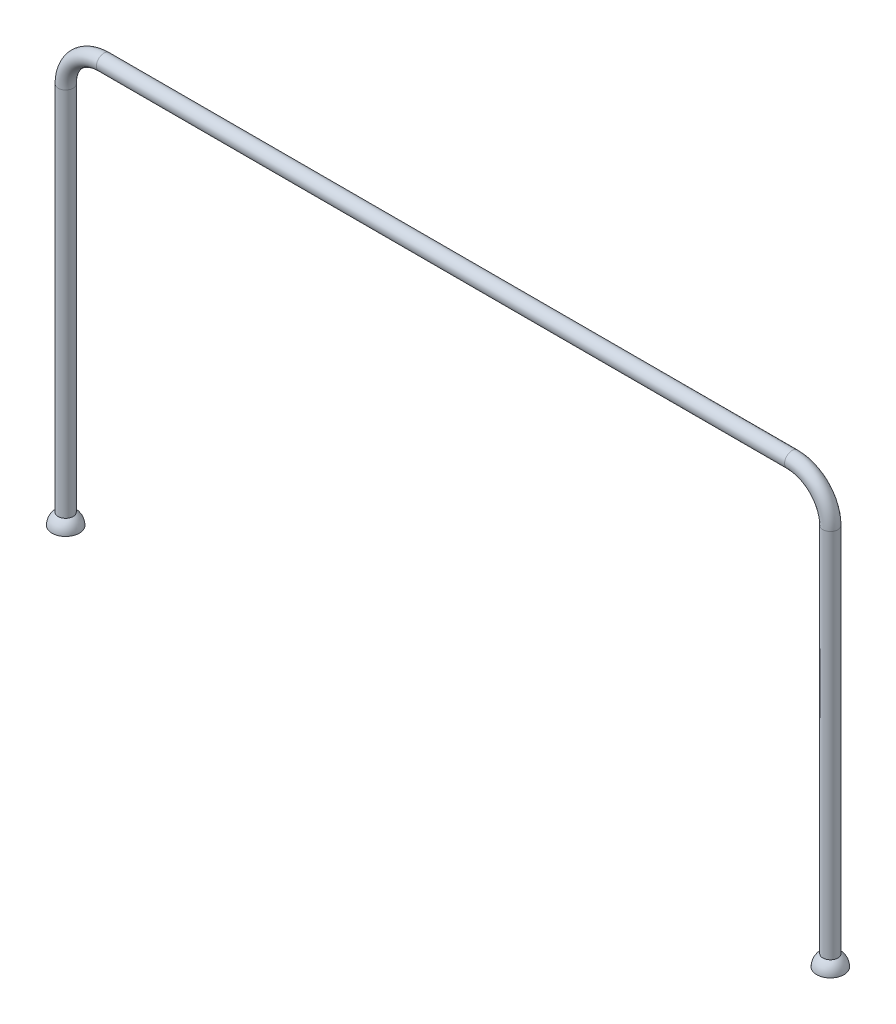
ISO-10303-21;
HEADER;
FILE_DESCRIPTION(('STEP AP214'),'2;1');
FILE_NAME('part.step','',(''),(''),'','','');
FILE_SCHEMA(('AUTOMOTIVE_DESIGN { 1 0 10303 214 1 1 1 1 }'));
ENDSEC;
DATA;
#1=APPLICATION_CONTEXT('core data for automotive mechanical design processes');
#2=APPLICATION_PROTOCOL_DEFINITION('international standard','automotive_design',2000,#1);
#3=PRODUCT_CONTEXT('',#1,'mechanical');
#4=PRODUCT('Part','Part','',(#3));
#5=PRODUCT_RELATED_PRODUCT_CATEGORY('part','',(#4));
#6=PRODUCT_DEFINITION_FORMATION('','',#4);
#7=PRODUCT_DEFINITION_CONTEXT('part definition',#1,'design');
#8=PRODUCT_DEFINITION('design','',#6,#7);
#9=PRODUCT_DEFINITION_SHAPE('','',#8);
#10=(LENGTH_UNIT() NAMED_UNIT(*) SI_UNIT(.MILLI.,.METRE.));
#11=(NAMED_UNIT(*) PLANE_ANGLE_UNIT() SI_UNIT($,.RADIAN.));
#12=(NAMED_UNIT(*) SI_UNIT($,.STERADIAN.) SOLID_ANGLE_UNIT());
#13=UNCERTAINTY_MEASURE_WITH_UNIT(LENGTH_MEASURE(1.E-05),#10,'distance_accuracy_value','');
#14=(GEOMETRIC_REPRESENTATION_CONTEXT(3) GLOBAL_UNCERTAINTY_ASSIGNED_CONTEXT((#13)) GLOBAL_UNIT_ASSIGNED_CONTEXT((#10,
#11,#12)) REPRESENTATION_CONTEXT('',''));
#15=CARTESIAN_POINT('',(0.,0.,0.));
#16=DIRECTION('',(0.,0.,1.));
#17=DIRECTION('',(1.,0.,0.));
#18=AXIS2_PLACEMENT_3D('',#15,#16,#17);
#19=CARTESIAN_POINT('',(70.,0.,0.));
#20=DIRECTION('',(0.,1.,0.));
#21=DIRECTION('',(0.,0.,1.));
#22=AXIS2_PLACEMENT_3D('',#19,#20,#21);
#23=CYLINDRICAL_SURFACE('',#22,1.375);
#24=CARTESIAN_POINT('',(70.,70.,0.));
#25=DIRECTION('',(0.,1.,0.));
#26=DIRECTION('',(0.,0.,1.));
#27=AXIS2_PLACEMENT_3D('',#24,#25,#26);
#28=CIRCLE('',#27,1.375);
#29=CARTESIAN_POINT('',(71.375,70.,0.));
#30=VERTEX_POINT('',#29);
#31=EDGE_CURVE('E60',#30,#30,#28,.T.);
#32=ORIENTED_EDGE('',*,*,#31,.F.);
#33=EDGE_LOOP('',(#32));
#34=FACE_BOUND('',#33,.T.);
#35=CARTESIAN_POINT('',(70.,2.08791163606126,0.));
#36=DIRECTION('',(0.,-1.,0.));
#37=DIRECTION('',(0.,0.,-1.));
#38=AXIS2_PLACEMENT_3D('',#35,#36,#37);
#39=CIRCLE('',#38,1.375);
#40=CARTESIAN_POINT('',(70.,2.08791163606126,-1.375));
#41=VERTEX_POINT('',#40);
#42=EDGE_CURVE('E46',#41,#41,#39,.F.);
#43=ORIENTED_EDGE('',*,*,#42,.T.);
#44=EDGE_LOOP('',(#43));
#45=FACE_BOUND('',#44,.T.);
#46=ADVANCED_FACE('F42',(#34,#45),#23,.T.);
#47=CARTESIAN_POINT('',(-70.,70.,0.));
#48=DIRECTION('',(0.,-1.,0.));
#49=DIRECTION('',(0.,0.,-1.));
#50=AXIS2_PLACEMENT_3D('',#47,#48,#49);
#51=CYLINDRICAL_SURFACE('',#50,1.375);
#52=CARTESIAN_POINT('',(-70.,70.,0.));
#53=DIRECTION('',(0.,-1.,0.));
#54=DIRECTION('',(0.,0.,1.));
#55=AXIS2_PLACEMENT_3D('',#52,#53,#54);
#56=CIRCLE('',#55,1.375);
#57=CARTESIAN_POINT('',(-71.375,70.,0.));
#58=VERTEX_POINT('',#57);
#59=EDGE_CURVE('E12',#58,#58,#56,.T.);
#60=ORIENTED_EDGE('',*,*,#59,.T.);
#61=EDGE_LOOP('',(#60));
#62=FACE_BOUND('',#61,.T.);
#63=CARTESIAN_POINT('',(-70.,2.08791163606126,0.));
#64=DIRECTION('',(0.,-1.,0.));
#65=DIRECTION('',(0.,0.,-1.));
#66=AXIS2_PLACEMENT_3D('',#63,#64,#65);
#67=CIRCLE('',#66,1.375);
#68=CARTESIAN_POINT('',(-70.,2.08791163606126,-1.375));
#69=VERTEX_POINT('',#68);
#70=EDGE_CURVE('E58',#69,#69,#67,.F.);
#71=ORIENTED_EDGE('',*,*,#70,.T.);
#72=EDGE_LOOP('',(#71));
#73=FACE_BOUND('',#72,.T.);
#74=ADVANCED_FACE('F82',(#62,#73),#51,.T.);
#75=CARTESIAN_POINT('',(63.,70.,0.));
#76=DIRECTION('',(0.,0.,1.));
#77=DIRECTION('',(1.,0.,0.));
#78=AXIS2_PLACEMENT_3D('',#75,#76,#77);
#79=TOROIDAL_SURFACE('',#78,6.99999999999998,1.375);
#80=CARTESIAN_POINT('',(63.,77.,0.));
#81=DIRECTION('',(-1.,0.,0.));
#82=DIRECTION('',(0.,0.,1.));
#83=AXIS2_PLACEMENT_3D('',#80,#81,#82);
#84=CIRCLE('',#83,1.375);
#85=CARTESIAN_POINT('',(63.,78.375,0.));
#86=VERTEX_POINT('',#85);
#87=EDGE_CURVE('E55',#86,#86,#84,.T.);
#88=CARTESIAN_POINT('',(63.,70.,0.));
#89=DIRECTION('',(0.,0.,1.));
#90=DIRECTION('',(1.,0.,0.));
#91=AXIS2_PLACEMENT_3D('',#88,#89,#90);
#92=CIRCLE('',#91,8.37499999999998);
#93=EDGE_CURVE('',#30,#86,#92,.T.);
#94=ORIENTED_EDGE('',*,*,#31,.T.);
#95=ORIENTED_EDGE('',*,*,#87,.F.);
#96=ORIENTED_EDGE('',*,*,#93,.T.);
#97=ORIENTED_EDGE('',*,*,#93,.F.);
#98=EDGE_LOOP('',(#94,#96,#95,#97));
#99=FACE_BOUND('',#98,.T.);
#100=ADVANCED_FACE('F79',(#99),#79,.T.);
#101=CARTESIAN_POINT('',(63.,77.,0.));
#102=DIRECTION('',(-1.,0.,0.));
#103=DIRECTION('',(0.,0.,1.));
#104=AXIS2_PLACEMENT_3D('',#101,#102,#103);
#105=CYLINDRICAL_SURFACE('',#104,1.375);
#106=CARTESIAN_POINT('',(-53.1,77.,-1.375));
#107=CARTESIAN_POINT('',(-53.1000013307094,77.0453737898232,-1.3749987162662));
#108=CARTESIAN_POINT('',(-53.1034511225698,77.0907598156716,-1.37273359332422));
#109=CARTESIAN_POINT('',(-53.1170440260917,77.1800952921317,-1.36389526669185));
#110=CARTESIAN_POINT('',(-53.1271920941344,77.2240436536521,-1.35731887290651));
#111=CARTESIAN_POINT('',(-53.1535684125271,77.3090750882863,-1.34051070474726));
#112=CARTESIAN_POINT('',(-53.1697680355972,77.3501705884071,-1.33029615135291));
#113=CARTESIAN_POINT('',(-53.2075662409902,77.4289031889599,-1.30704039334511));
#114=CARTESIAN_POINT('',(-53.2291654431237,77.4665398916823,-1.29399886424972));
#115=CARTESIAN_POINT('',(-53.2791196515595,77.5408327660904,-1.26485058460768));
#116=CARTESIAN_POINT('',(-53.3078880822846,77.577144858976,-1.24857884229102));
#117=CARTESIAN_POINT('',(-53.3703874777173,77.6447571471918,-1.21504765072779));
#118=CARTESIAN_POINT('',(-53.4041253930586,77.6760501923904,-1.19778683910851));
#119=CARTESIAN_POINT('',(-53.4815436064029,77.7375676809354,-1.16107070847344));
#120=CARTESIAN_POINT('',(-53.5259559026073,77.7669154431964,-1.14167810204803));
#121=CARTESIAN_POINT('',(-53.6201928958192,77.8176785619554,-1.10588987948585));
#122=CARTESIAN_POINT('',(-53.6700080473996,77.8391076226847,-1.08948911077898));
#123=CARTESIAN_POINT('',(-53.759532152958,77.8681742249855,-1.06636883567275));
#124=CARTESIAN_POINT('',(-53.7981612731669,77.8779937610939,-1.05822428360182));
#125=CARTESIAN_POINT('',(-53.8769857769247,77.8924498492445,-1.04606405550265));
#126=CARTESIAN_POINT('',(-53.9171784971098,77.8970948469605,-1.04204165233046));
#127=CARTESIAN_POINT('',(-53.9981724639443,77.9009136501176,-1.03874316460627));
#128=CARTESIAN_POINT('',(-54.0389753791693,77.9000677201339,-1.03948420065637));
#129=CARTESIAN_POINT('',(-54.1197560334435,77.8929198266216,-1.0456286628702));
#130=CARTESIAN_POINT('',(-54.159733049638,77.8866132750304,-1.05103600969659));
#131=CARTESIAN_POINT('',(-54.2363222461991,77.8692745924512,-1.06541342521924));
#132=CARTESIAN_POINT('',(-54.2730043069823,77.8584273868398,-1.07424316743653));
#133=CARTESIAN_POINT('',(-54.3440719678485,77.8324945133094,-1.09446223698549));
#134=CARTESIAN_POINT('',(-54.3784568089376,77.8174074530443,-1.10585240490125));
#135=CARTESIAN_POINT('',(-54.4512438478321,77.7799816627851,-1.13264369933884));
#136=CARTESIAN_POINT('',(-54.4890825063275,77.7567971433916,-1.14839187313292));
#137=CARTESIAN_POINT('',(-54.5607693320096,77.7053284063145,-1.18070427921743));
#138=CARTESIAN_POINT('',(-54.5946125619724,77.6770379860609,-1.19726948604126));
#139=CARTESIAN_POINT('',(-54.6642776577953,77.6095361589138,-1.23321911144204));
#140=CARTESIAN_POINT('',(-54.6991418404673,77.5692721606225,-1.25250486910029));
#141=CARTESIAN_POINT('',(-54.7616416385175,77.4824462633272,-1.28843754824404));
#142=CARTESIAN_POINT('',(-54.789284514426,77.4358907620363,-1.30508711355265));
#143=CARTESIAN_POINT('',(-54.8314903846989,77.3471831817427,-1.33108379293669));
#144=CARTESIAN_POINT('',(-54.8475588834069,77.3059804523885,-1.34122386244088));
#145=CARTESIAN_POINT('',(-54.8735772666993,77.220982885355,-1.35781479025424));
#146=CARTESIAN_POINT('',(-54.8835322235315,77.1771902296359,-1.36426870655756));
#147=CARTESIAN_POINT('',(-54.8968239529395,77.0880114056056,-1.37291380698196));
#148=CARTESIAN_POINT('',(-54.9001351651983,77.0426197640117,-1.37508852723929));
#149=CARTESIAN_POINT('',(-54.8998563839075,76.9518645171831,-1.37490594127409));
#150=CARTESIAN_POINT('',(-54.89626642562,76.9065009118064,-1.37254865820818));
#151=CARTESIAN_POINT('',(-54.8828440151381,76.8200514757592,-1.36382370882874));
#152=CARTESIAN_POINT('',(-54.8734141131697,76.7788751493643,-1.3577148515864));
#153=CARTESIAN_POINT('',(-54.8491393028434,76.6988129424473,-1.34222779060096));
#154=CARTESIAN_POINT('',(-54.8342935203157,76.6599274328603,-1.33284905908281));
#155=CARTESIAN_POINT('',(-54.7985886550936,76.5826403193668,-1.31078543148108));
#156=CARTESIAN_POINT('',(-54.7773922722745,76.5444471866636,-1.29792058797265));
#157=CARTESIAN_POINT('',(-54.730133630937,76.4720053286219,-1.27017877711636));
#158=CARTESIAN_POINT('',(-54.7040679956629,76.4377593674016,-1.25530041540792));
#159=CARTESIAN_POINT('',(-54.6431996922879,76.3685427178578,-1.22212077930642));
#160=CARTESIAN_POINT('',(-54.60766825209,76.3342945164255,-1.2036478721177));
#161=CARTESIAN_POINT('',(-54.5313900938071,76.2719529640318,-1.16699632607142));
#162=CARTESIAN_POINT('',(-54.4906408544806,76.2438626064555,-1.14881783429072));
#163=CARTESIAN_POINT('',(-54.4091441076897,76.1971577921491,-1.11659459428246));
#164=CARTESIAN_POINT('',(-54.3688954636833,76.1778386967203,-1.10231501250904));
#165=CARTESIAN_POINT('',(-54.2850640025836,76.145158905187,-1.0771718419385));
#166=CARTESIAN_POINT('',(-54.2414873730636,76.1317874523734,-1.06630209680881));
#167=CARTESIAN_POINT('',(-54.1589694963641,76.1133087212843,-1.05096412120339));
#168=CARTESIAN_POINT('',(-54.1203876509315,76.1072277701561,-1.04575452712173));
#169=CARTESIAN_POINT('',(-54.0424326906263,76.1001513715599,-1.03967359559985));
#170=CARTESIAN_POINT('',(-54.0030602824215,76.0991515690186,-1.03879854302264));
#171=CARTESIAN_POINT('',(-53.9247022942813,76.1022985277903,-1.04151831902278));
#172=CARTESIAN_POINT('',(-53.8857165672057,76.1064432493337,-1.04511137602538));
#173=CARTESIAN_POINT('',(-53.809139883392,76.1196099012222,-1.05622452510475));
#174=CARTESIAN_POINT('',(-53.7715508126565,76.1286381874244,-1.06374973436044));
#175=CARTESIAN_POINT('',(-53.688032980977,76.1543672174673,-1.08437631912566));
#176=CARTESIAN_POINT('',(-53.6427986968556,76.1725247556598,-1.09845742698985));
#177=CARTESIAN_POINT('',(-53.556574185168,76.2153349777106,-1.12943479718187));
#178=CARTESIAN_POINT('',(-53.5155899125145,76.2399966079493,-1.1463349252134));
#179=CARTESIAN_POINT('',(-53.437643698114,76.2956671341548,-1.18137201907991));
#180=CARTESIAN_POINT('',(-53.4007581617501,76.3267728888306,-1.19952464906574));
#181=CARTESIAN_POINT('',(-53.3322478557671,76.3946629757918,-1.23517733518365));
#182=CARTESIAN_POINT('',(-53.3006244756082,76.4314488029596,-1.25267721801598));
#183=CARTESIAN_POINT('',(-53.2401120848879,76.5147107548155,-1.28739028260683));
#184=CARTESIAN_POINT('',(-53.2119254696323,76.5618106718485,-1.30435206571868));
#185=CARTESIAN_POINT('',(-53.1642631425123,76.6615062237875,-1.33368952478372));
#186=CARTESIAN_POINT('',(-53.1447692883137,76.714090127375,-1.34607474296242));
#187=CARTESIAN_POINT('',(-53.1203260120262,76.8058976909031,-1.36176199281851));
#188=CARTESIAN_POINT('',(-53.1127344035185,76.84415507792,-1.36669345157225));
#189=CARTESIAN_POINT('',(-53.1025718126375,76.9216055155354,-1.37331237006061));
#190=CARTESIAN_POINT('',(-53.0999988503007,76.9607981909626,-1.37500110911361));
#191=CARTESIAN_POINT('',(-53.1,77.,-1.375));
#192=B_SPLINE_CURVE_WITH_KNOTS('',3,(#106,#107,#108,#109,#110,#111,#112,#113,#114,#115,#116,
#117,#118,#119,#120,#121,#122,#123,#124,#125,#126,#127,#128,#129,#130,#131,#132,#133,#134,#135,
#136,#137,#138,#139,#140,#141,#142,#143,#144,#145,#146,#147,#148,#149,#150,#151,#152,#153,#154,
#155,#156,#157,#158,#159,#160,#161,#162,#163,#164,#165,#166,#167,#168,#169,#170,#171,#172,#173,
#174,#175,#176,#177,#178,#179,#180,#181,#182,#183,#184,#185,#186,#187,#188,#189,#190,#191),
.UNSPECIFIED.,.T.,.F.,(4,2,2,2,2,2,2,2,2,2,2,2,2,2,2,2,2,2,2,2,2,2,2,2,2,2,2,2,2,2,2,2,2,2,2,2,
2,2,2,2,2,2,4),(0.,0.135962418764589,0.272025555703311,0.407453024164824,0.542896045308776,
0.6896446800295,0.836600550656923,1.00577202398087,1.17464933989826,1.2962024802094,
1.41755693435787,1.53934780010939,1.66124109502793,1.7785904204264,1.89597832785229,
2.03674243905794,2.1776787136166,2.34679835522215,2.51574729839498,2.65129176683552,
2.78672362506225,2.92267553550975,3.05862675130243,3.18611411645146,3.3136220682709,
3.4497064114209,3.58588547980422,3.74333764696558,3.90086618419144,4.04096165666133,
4.18080271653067,4.29848861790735,4.41607363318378,4.53361204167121,4.65130379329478,
4.80269998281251,4.954305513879,5.10838086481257,5.26249683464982,5.43386535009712,
5.60487451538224,5.72238898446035,5.83985708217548),.UNSPECIFIED.);
#193=CARTESIAN_POINT('',(-53.1,77.,-1.375));
#194=VERTEX_POINT('',#193);
#195=EDGE_CURVE('E102',#194,#194,#192,.T.);
#196=ORIENTED_EDGE('',*,*,#195,.T.);
#197=EDGE_LOOP('',(#196));
#198=FACE_BOUND('',#197,.T.);
#199=CARTESIAN_POINT('',(-35.1,77.,-1.375));
#200=CARTESIAN_POINT('',(-35.1000013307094,77.0453737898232,-1.3749987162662));
#201=CARTESIAN_POINT('',(-35.1034511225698,77.0907598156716,-1.37273359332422));
#202=CARTESIAN_POINT('',(-35.1170440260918,77.1800952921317,-1.36389526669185));
#203=CARTESIAN_POINT('',(-35.1271920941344,77.2240436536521,-1.35731887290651));
#204=CARTESIAN_POINT('',(-35.1535684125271,77.3090750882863,-1.34051070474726));
#205=CARTESIAN_POINT('',(-35.1697680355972,77.3501705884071,-1.33029615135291));
#206=CARTESIAN_POINT('',(-35.2075662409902,77.4289031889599,-1.30704039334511));
#207=CARTESIAN_POINT('',(-35.2291654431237,77.4665398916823,-1.29399886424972));
#208=CARTESIAN_POINT('',(-35.2791196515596,77.5408327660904,-1.26485058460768));
#209=CARTESIAN_POINT('',(-35.3078880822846,77.577144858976,-1.24857884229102));
#210=CARTESIAN_POINT('',(-35.3703874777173,77.6447571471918,-1.21504765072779));
#211=CARTESIAN_POINT('',(-35.4041253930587,77.6760501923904,-1.19778683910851));
#212=CARTESIAN_POINT('',(-35.4815436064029,77.7375676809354,-1.16107070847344));
#213=CARTESIAN_POINT('',(-35.5259559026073,77.7669154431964,-1.14167810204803));
#214=CARTESIAN_POINT('',(-35.6201928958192,77.8176785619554,-1.10588987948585));
#215=CARTESIAN_POINT('',(-35.6700080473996,77.8391076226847,-1.08948911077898));
#216=CARTESIAN_POINT('',(-35.759532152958,77.8681742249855,-1.06636883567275));
#217=CARTESIAN_POINT('',(-35.7981612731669,77.8779937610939,-1.05822428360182));
#218=CARTESIAN_POINT('',(-35.8769857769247,77.8924498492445,-1.04606405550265));
#219=CARTESIAN_POINT('',(-35.9171784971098,77.8970948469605,-1.04204165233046));
#220=CARTESIAN_POINT('',(-35.9981724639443,77.9009136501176,-1.03874316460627));
#221=CARTESIAN_POINT('',(-36.0389753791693,77.9000677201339,-1.03948420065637));
#222=CARTESIAN_POINT('',(-36.1197560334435,77.8929198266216,-1.0456286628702));
#223=CARTESIAN_POINT('',(-36.159733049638,77.8866132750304,-1.05103600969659));
#224=CARTESIAN_POINT('',(-36.2363222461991,77.8692745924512,-1.06541342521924));
#225=CARTESIAN_POINT('',(-36.2730043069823,77.8584273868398,-1.07424316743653));
#226=CARTESIAN_POINT('',(-36.3440719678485,77.8324945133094,-1.09446223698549));
#227=CARTESIAN_POINT('',(-36.3784568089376,77.8174074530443,-1.10585240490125));
#228=CARTESIAN_POINT('',(-36.4512438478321,77.7799816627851,-1.13264369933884));
#229=CARTESIAN_POINT('',(-36.4890825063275,77.7567971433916,-1.14839187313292));
#230=CARTESIAN_POINT('',(-36.5607693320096,77.7053284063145,-1.18070427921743));
#231=CARTESIAN_POINT('',(-36.5946125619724,77.6770379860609,-1.19726948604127));
#232=CARTESIAN_POINT('',(-36.6642776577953,77.6095361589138,-1.23321911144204));
#233=CARTESIAN_POINT('',(-36.6991418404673,77.5692721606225,-1.25250486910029));
#234=CARTESIAN_POINT('',(-36.7616416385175,77.4824462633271,-1.28843754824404));
#235=CARTESIAN_POINT('',(-36.789284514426,77.4358907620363,-1.30508711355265));
#236=CARTESIAN_POINT('',(-36.8314903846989,77.3471831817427,-1.33108379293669));
#237=CARTESIAN_POINT('',(-36.8475588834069,77.3059804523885,-1.34122386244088));
#238=CARTESIAN_POINT('',(-36.8735772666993,77.220982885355,-1.35781479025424));
#239=CARTESIAN_POINT('',(-36.8835322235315,77.1771902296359,-1.36426870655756));
#240=CARTESIAN_POINT('',(-36.8968239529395,77.0880114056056,-1.37291380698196));
#241=CARTESIAN_POINT('',(-36.9001351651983,77.0426197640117,-1.37508852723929));
#242=CARTESIAN_POINT('',(-36.8998563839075,76.9518645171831,-1.37490594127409));
#243=CARTESIAN_POINT('',(-36.89626642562,76.9065009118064,-1.37254865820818));
#244=CARTESIAN_POINT('',(-36.8828440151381,76.8200514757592,-1.36382370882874));
#245=CARTESIAN_POINT('',(-36.8734141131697,76.7788751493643,-1.3577148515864));
#246=CARTESIAN_POINT('',(-36.8491393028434,76.6988129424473,-1.34222779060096));
#247=CARTESIAN_POINT('',(-36.8342935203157,76.6599274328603,-1.33284905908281));
#248=CARTESIAN_POINT('',(-36.7985886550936,76.5826403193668,-1.31078543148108));
#249=CARTESIAN_POINT('',(-36.7773922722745,76.5444471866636,-1.29792058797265));
#250=CARTESIAN_POINT('',(-36.730133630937,76.4720053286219,-1.27017877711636));
#251=CARTESIAN_POINT('',(-36.7040679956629,76.4377593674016,-1.25530041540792));
#252=CARTESIAN_POINT('',(-36.6431996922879,76.3685427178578,-1.22212077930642));
#253=CARTESIAN_POINT('',(-36.60766825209,76.3342945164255,-1.2036478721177));
#254=CARTESIAN_POINT('',(-36.5313900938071,76.2719529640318,-1.16699632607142));
#255=CARTESIAN_POINT('',(-36.4906408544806,76.2438626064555,-1.14881783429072));
#256=CARTESIAN_POINT('',(-36.4091441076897,76.1971577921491,-1.11659459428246));
#257=CARTESIAN_POINT('',(-36.3688954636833,76.1778386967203,-1.10231501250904));
#258=CARTESIAN_POINT('',(-36.2850640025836,76.145158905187,-1.0771718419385));
#259=CARTESIAN_POINT('',(-36.2414873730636,76.1317874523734,-1.06630209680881));
#260=CARTESIAN_POINT('',(-36.1589694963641,76.1133087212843,-1.05096412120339));
#261=CARTESIAN_POINT('',(-36.1203876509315,76.1072277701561,-1.04575452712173));
#262=CARTESIAN_POINT('',(-36.0424326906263,76.1001513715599,-1.03967359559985));
#263=CARTESIAN_POINT('',(-36.0030602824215,76.0991515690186,-1.03879854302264));
#264=CARTESIAN_POINT('',(-35.9247022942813,76.1022985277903,-1.04151831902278));
#265=CARTESIAN_POINT('',(-35.8857165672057,76.1064432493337,-1.04511137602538));
#266=CARTESIAN_POINT('',(-35.8091398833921,76.1196099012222,-1.05622452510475));
#267=CARTESIAN_POINT('',(-35.7715508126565,76.1286381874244,-1.06374973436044));
#268=CARTESIAN_POINT('',(-35.688032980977,76.1543672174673,-1.08437631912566));
#269=CARTESIAN_POINT('',(-35.6427986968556,76.1725247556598,-1.09845742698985));
#270=CARTESIAN_POINT('',(-35.556574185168,76.2153349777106,-1.12943479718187));
#271=CARTESIAN_POINT('',(-35.5155899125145,76.2399966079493,-1.1463349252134));
#272=CARTESIAN_POINT('',(-35.437643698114,76.2956671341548,-1.18137201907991));
#273=CARTESIAN_POINT('',(-35.4007581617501,76.3267728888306,-1.19952464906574));
#274=CARTESIAN_POINT('',(-35.3322478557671,76.3946629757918,-1.23517733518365));
#275=CARTESIAN_POINT('',(-35.3006244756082,76.4314488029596,-1.25267721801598));
#276=CARTESIAN_POINT('',(-35.2401120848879,76.5147107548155,-1.28739028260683));
#277=CARTESIAN_POINT('',(-35.2119254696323,76.5618106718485,-1.30435206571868));
#278=CARTESIAN_POINT('',(-35.1642631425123,76.6615062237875,-1.33368952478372));
#279=CARTESIAN_POINT('',(-35.1447692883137,76.714090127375,-1.34607474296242));
#280=CARTESIAN_POINT('',(-35.1203260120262,76.805897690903,-1.36176199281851));
#281=CARTESIAN_POINT('',(-35.1127344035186,76.84415507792,-1.36669345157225));
#282=CARTESIAN_POINT('',(-35.1025718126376,76.9216055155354,-1.37331237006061));
#283=CARTESIAN_POINT('',(-35.0999988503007,76.9607981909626,-1.37500110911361));
#284=CARTESIAN_POINT('',(-35.1,77.,-1.375));
#285=B_SPLINE_CURVE_WITH_KNOTS('',3,(#199,#200,#201,#202,#203,#204,#205,#206,#207,#208,#209,
#210,#211,#212,#213,#214,#215,#216,#217,#218,#219,#220,#221,#222,#223,#224,#225,#226,#227,#228,
#229,#230,#231,#232,#233,#234,#235,#236,#237,#238,#239,#240,#241,#242,#243,#244,#245,#246,#247,
#248,#249,#250,#251,#252,#253,#254,#255,#256,#257,#258,#259,#260,#261,#262,#263,#264,#265,#266,
#267,#268,#269,#270,#271,#272,#273,#274,#275,#276,#277,#278,#279,#280,#281,#282,#283,#284),
.UNSPECIFIED.,.T.,.F.,(4,2,2,2,2,2,2,2,2,2,2,2,2,2,2,2,2,2,2,2,2,2,2,2,2,2,2,2,2,2,2,2,2,2,2,2,
2,2,2,2,2,2,4),(0.,0.135962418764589,0.272025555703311,0.407453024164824,0.542896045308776,
0.6896446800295,0.836600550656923,1.00577202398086,1.17464933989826,1.2962024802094,
1.41755693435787,1.53934780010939,1.66124109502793,1.7785904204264,1.89597832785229,
2.03674243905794,2.1776787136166,2.34679835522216,2.51574729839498,2.65129176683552,
2.78672362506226,2.92267553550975,3.05862675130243,3.18611411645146,3.3136220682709,
3.4497064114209,3.58588547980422,3.74333764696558,3.90086618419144,4.04096165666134,
4.18080271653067,4.29848861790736,4.41607363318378,4.53361204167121,4.65130379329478,
4.80269998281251,4.954305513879,5.10838086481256,5.26249683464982,5.43386535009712,
5.60487451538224,5.72238898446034,5.83985708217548),.UNSPECIFIED.);
#286=CARTESIAN_POINT('',(-35.1,77.,-1.375));
#287=VERTEX_POINT('',#286);
#288=EDGE_CURVE('E144',#287,#287,#285,.T.);
#289=ORIENTED_EDGE('',*,*,#288,.T.);
#290=EDGE_LOOP('',(#289));
#291=FACE_BOUND('',#290,.T.);
#292=CARTESIAN_POINT('',(-17.1,77.,-1.375));
#293=CARTESIAN_POINT('',(-17.1000013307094,77.0453737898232,-1.3749987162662));
#294=CARTESIAN_POINT('',(-17.1034511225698,77.0907598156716,-1.37273359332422));
#295=CARTESIAN_POINT('',(-17.1170440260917,77.1800952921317,-1.36389526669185));
#296=CARTESIAN_POINT('',(-17.1271920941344,77.2240436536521,-1.35731887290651));
#297=CARTESIAN_POINT('',(-17.1535684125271,77.3090750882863,-1.34051070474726));
#298=CARTESIAN_POINT('',(-17.1697680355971,77.3501705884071,-1.33029615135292));
#299=CARTESIAN_POINT('',(-17.2075662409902,77.4289031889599,-1.30704039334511));
#300=CARTESIAN_POINT('',(-17.2291654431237,77.4665398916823,-1.29399886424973));
#301=CARTESIAN_POINT('',(-17.2791196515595,77.5408327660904,-1.26485058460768));
#302=CARTESIAN_POINT('',(-17.3078880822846,77.577144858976,-1.24857884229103));
#303=CARTESIAN_POINT('',(-17.3703874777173,77.6447571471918,-1.21504765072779));
#304=CARTESIAN_POINT('',(-17.4041253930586,77.6760501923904,-1.19778683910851));
#305=CARTESIAN_POINT('',(-17.4815436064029,77.7375676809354,-1.16107070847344));
#306=CARTESIAN_POINT('',(-17.5259559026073,77.7669154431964,-1.14167810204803));
#307=CARTESIAN_POINT('',(-17.6201928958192,77.8176785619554,-1.10588987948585));
#308=CARTESIAN_POINT('',(-17.6700080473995,77.8391076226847,-1.08948911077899));
#309=CARTESIAN_POINT('',(-17.7595321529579,77.8681742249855,-1.06636883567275));
#310=CARTESIAN_POINT('',(-17.7981612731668,77.8779937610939,-1.05822428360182));
#311=CARTESIAN_POINT('',(-17.8769857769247,77.8924498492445,-1.04606405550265));
#312=CARTESIAN_POINT('',(-17.9171784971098,77.8970948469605,-1.04204165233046));
#313=CARTESIAN_POINT('',(-17.9981724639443,77.9009136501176,-1.03874316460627));
#314=CARTESIAN_POINT('',(-18.0389753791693,77.900067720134,-1.03948420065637));
#315=CARTESIAN_POINT('',(-18.1197560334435,77.8929198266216,-1.0456286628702));
#316=CARTESIAN_POINT('',(-18.159733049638,77.8866132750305,-1.05103600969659));
#317=CARTESIAN_POINT('',(-18.2363222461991,77.8692745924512,-1.06541342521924));
#318=CARTESIAN_POINT('',(-18.2730043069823,77.8584273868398,-1.07424316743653));
#319=CARTESIAN_POINT('',(-18.3440719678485,77.8324945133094,-1.09446223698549));
#320=CARTESIAN_POINT('',(-18.3784568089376,77.8174074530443,-1.10585240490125));
#321=CARTESIAN_POINT('',(-18.4512438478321,77.7799816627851,-1.13264369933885));
#322=CARTESIAN_POINT('',(-18.4890825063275,77.7567971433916,-1.14839187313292));
#323=CARTESIAN_POINT('',(-18.5607693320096,77.7053284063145,-1.18070427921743));
#324=CARTESIAN_POINT('',(-18.5946125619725,77.6770379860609,-1.19726948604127));
#325=CARTESIAN_POINT('',(-18.6642776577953,77.6095361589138,-1.23321911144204));
#326=CARTESIAN_POINT('',(-18.6991418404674,77.5692721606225,-1.2525048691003));
#327=CARTESIAN_POINT('',(-18.7616416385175,77.4824462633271,-1.28843754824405));
#328=CARTESIAN_POINT('',(-18.789284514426,77.4358907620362,-1.30508711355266));
#329=CARTESIAN_POINT('',(-18.8314903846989,77.3471831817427,-1.33108379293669));
#330=CARTESIAN_POINT('',(-18.8475588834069,77.3059804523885,-1.34122386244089));
#331=CARTESIAN_POINT('',(-18.8735772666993,77.2209828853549,-1.35781479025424));
#332=CARTESIAN_POINT('',(-18.8835322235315,77.1771902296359,-1.36426870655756));
#333=CARTESIAN_POINT('',(-18.8968239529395,77.0880114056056,-1.37291380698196));
#334=CARTESIAN_POINT('',(-18.9001351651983,77.0426197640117,-1.37508852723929));
#335=CARTESIAN_POINT('',(-18.8998563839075,76.9518645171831,-1.37490594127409));
#336=CARTESIAN_POINT('',(-18.89626642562,76.9065009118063,-1.37254865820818));
#337=CARTESIAN_POINT('',(-18.8828440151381,76.8200514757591,-1.36382370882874));
#338=CARTESIAN_POINT('',(-18.8734141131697,76.7788751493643,-1.3577148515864));
#339=CARTESIAN_POINT('',(-18.8491393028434,76.6988129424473,-1.34222779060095));
#340=CARTESIAN_POINT('',(-18.8342935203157,76.6599274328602,-1.3328490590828));
#341=CARTESIAN_POINT('',(-18.7985886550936,76.5826403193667,-1.31078543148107));
#342=CARTESIAN_POINT('',(-18.7773922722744,76.5444471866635,-1.29792058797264));
#343=CARTESIAN_POINT('',(-18.730133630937,76.4720053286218,-1.27017877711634));
#344=CARTESIAN_POINT('',(-18.7040679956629,76.4377593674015,-1.2553004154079));
#345=CARTESIAN_POINT('',(-18.6431996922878,76.3685427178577,-1.2221207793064));
#346=CARTESIAN_POINT('',(-18.60766825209,76.3342945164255,-1.20364787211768));
#347=CARTESIAN_POINT('',(-18.5313900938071,76.2719529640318,-1.16699632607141));
#348=CARTESIAN_POINT('',(-18.4906408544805,76.2438626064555,-1.14881783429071));
#349=CARTESIAN_POINT('',(-18.4091441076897,76.197157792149,-1.11659459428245));
#350=CARTESIAN_POINT('',(-18.3688954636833,76.1778386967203,-1.10231501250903));
#351=CARTESIAN_POINT('',(-18.2850640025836,76.145158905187,-1.07717184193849));
#352=CARTESIAN_POINT('',(-18.2414873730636,76.1317874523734,-1.0663020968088));
#353=CARTESIAN_POINT('',(-18.1589694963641,76.1133087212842,-1.05096412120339));
#354=CARTESIAN_POINT('',(-18.1203876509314,76.1072277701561,-1.04575452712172));
#355=CARTESIAN_POINT('',(-18.0424326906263,76.1001513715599,-1.03967359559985));
#356=CARTESIAN_POINT('',(-18.0030602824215,76.0991515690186,-1.03879854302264));
#357=CARTESIAN_POINT('',(-17.9247022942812,76.1022985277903,-1.04151831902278));
#358=CARTESIAN_POINT('',(-17.8857165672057,76.1064432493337,-1.04511137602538));
#359=CARTESIAN_POINT('',(-17.809139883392,76.1196099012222,-1.05622452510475));
#360=CARTESIAN_POINT('',(-17.7715508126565,76.1286381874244,-1.06374973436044));
#361=CARTESIAN_POINT('',(-17.688032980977,76.1543672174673,-1.08437631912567));
#362=CARTESIAN_POINT('',(-17.6427986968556,76.1725247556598,-1.09845742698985));
#363=CARTESIAN_POINT('',(-17.556574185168,76.2153349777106,-1.12943479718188));
#364=CARTESIAN_POINT('',(-17.5155899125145,76.2399966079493,-1.14633492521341));
#365=CARTESIAN_POINT('',(-17.437643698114,76.2956671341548,-1.18137201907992));
#366=CARTESIAN_POINT('',(-17.4007581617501,76.3267728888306,-1.19952464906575));
#367=CARTESIAN_POINT('',(-17.3322478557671,76.3946629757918,-1.23517733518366));
#368=CARTESIAN_POINT('',(-17.3006244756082,76.4314488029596,-1.25267721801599));
#369=CARTESIAN_POINT('',(-17.2401120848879,76.5147107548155,-1.28739028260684));
#370=CARTESIAN_POINT('',(-17.2119254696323,76.5618106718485,-1.30435206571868));
#371=CARTESIAN_POINT('',(-17.1642631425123,76.6615062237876,-1.33368952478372));
#372=CARTESIAN_POINT('',(-17.1447692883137,76.714090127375,-1.34607474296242));
#373=CARTESIAN_POINT('',(-17.1203260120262,76.8058976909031,-1.36176199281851));
#374=CARTESIAN_POINT('',(-17.1127344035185,76.84415507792,-1.36669345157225));
#375=CARTESIAN_POINT('',(-17.1025718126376,76.9216055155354,-1.37331237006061));
#376=CARTESIAN_POINT('',(-17.0999988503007,76.9607981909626,-1.37500110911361));
#377=CARTESIAN_POINT('',(-17.1,77.,-1.375));
#378=B_SPLINE_CURVE_WITH_KNOTS('',3,(#292,#293,#294,#295,#296,#297,#298,#299,#300,#301,#302,
#303,#304,#305,#306,#307,#308,#309,#310,#311,#312,#313,#314,#315,#316,#317,#318,#319,#320,#321,
#322,#323,#324,#325,#326,#327,#328,#329,#330,#331,#332,#333,#334,#335,#336,#337,#338,#339,#340,
#341,#342,#343,#344,#345,#346,#347,#348,#349,#350,#351,#352,#353,#354,#355,#356,#357,#358,#359,
#360,#361,#362,#363,#364,#365,#366,#367,#368,#369,#370,#371,#372,#373,#374,#375,#376,#377),
.UNSPECIFIED.,.T.,.F.,(4,2,2,2,2,2,2,2,2,2,2,2,2,2,2,2,2,2,2,2,2,2,2,2,2,2,2,2,2,2,2,2,2,2,2,2,
2,2,2,2,2,2,4),(0.,0.135962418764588,0.27202555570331,0.40745302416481,0.54289604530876,
0.689644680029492,0.836600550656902,1.00577202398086,1.17464933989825,1.29620248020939,
1.41755693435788,1.5393478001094,1.66124109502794,1.77859042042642,1.89597832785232,
2.03674243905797,2.17767871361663,2.34679835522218,2.51574729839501,2.65129176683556,
2.7867236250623,2.92267553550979,3.05862675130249,3.1861141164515,3.31362206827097,
3.44970641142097,3.58588547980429,3.74333764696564,3.90086618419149,4.04096165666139,
4.18080271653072,4.2984886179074,4.41607363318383,4.53361204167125,4.65130379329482,
4.80269998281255,4.95430551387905,5.10838086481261,5.26249683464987,5.43386535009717,
5.60487451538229,5.72238898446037,5.83985708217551),.UNSPECIFIED.);
#379=CARTESIAN_POINT('',(-17.1,77.,-1.375));
#380=VERTEX_POINT('',#379);
#381=EDGE_CURVE('E148',#380,#380,#378,.T.);
#382=ORIENTED_EDGE('',*,*,#381,.T.);
#383=EDGE_LOOP('',(#382));
#384=FACE_BOUND('',#383,.T.);
#385=CARTESIAN_POINT('',(0.899999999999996,77.,-1.375));
#386=CARTESIAN_POINT('',(0.899998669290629,77.0453737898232,-1.3749987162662));
#387=CARTESIAN_POINT('',(0.896548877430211,77.0907598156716,-1.37273359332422));
#388=CARTESIAN_POINT('',(0.882955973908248,77.1800952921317,-1.36389526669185));
#389=CARTESIAN_POINT('',(0.87280790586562,77.2240436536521,-1.35731887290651));
#390=CARTESIAN_POINT('',(0.846431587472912,77.3090750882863,-1.34051070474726));
#391=CARTESIAN_POINT('',(0.830231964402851,77.3501705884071,-1.33029615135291));
#392=CARTESIAN_POINT('',(0.792433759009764,77.4289031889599,-1.30704039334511));
#393=CARTESIAN_POINT('',(0.770834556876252,77.4665398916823,-1.29399886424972));
#394=CARTESIAN_POINT('',(0.720880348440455,77.5408327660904,-1.26485058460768));
#395=CARTESIAN_POINT('',(0.692111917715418,77.577144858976,-1.24857884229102));
#396=CARTESIAN_POINT('',(0.629612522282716,77.6447571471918,-1.21504765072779));
#397=CARTESIAN_POINT('',(0.59587460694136,77.6760501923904,-1.19778683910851));
#398=CARTESIAN_POINT('',(0.518456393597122,77.7375676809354,-1.16107070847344));
#399=CARTESIAN_POINT('',(0.474044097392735,77.7669154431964,-1.14167810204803));
#400=CARTESIAN_POINT('',(0.379807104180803,77.8176785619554,-1.10588987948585));
#401=CARTESIAN_POINT('',(0.329991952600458,77.8391076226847,-1.08948911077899));
#402=CARTESIAN_POINT('',(0.240467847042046,77.8681742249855,-1.06636883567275));
#403=CARTESIAN_POINT('',(0.20183872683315,77.8779937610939,-1.05822428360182));
#404=CARTESIAN_POINT('',(0.123014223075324,77.8924498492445,-1.04606405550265));
#405=CARTESIAN_POINT('',(0.0828215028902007,77.8970948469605,-1.04204165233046));
#406=CARTESIAN_POINT('',(0.00182753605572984,77.9009136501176,-1.03874316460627));
#407=CARTESIAN_POINT('',(-0.0389753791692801,77.900067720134,-1.03948420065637));
#408=CARTESIAN_POINT('',(-0.119756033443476,77.8929198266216,-1.0456286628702));
#409=CARTESIAN_POINT('',(-0.159733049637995,77.8866132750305,-1.05103600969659));
#410=CARTESIAN_POINT('',(-0.236322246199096,77.8692745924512,-1.06541342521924));
#411=CARTESIAN_POINT('',(-0.273004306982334,77.8584273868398,-1.07424316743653));
#412=CARTESIAN_POINT('',(-0.344071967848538,77.8324945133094,-1.09446223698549));
#413=CARTESIAN_POINT('',(-0.378456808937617,77.8174074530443,-1.10585240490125));
#414=CARTESIAN_POINT('',(-0.45124384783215,77.7799816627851,-1.13264369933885));
#415=CARTESIAN_POINT('',(-0.489082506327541,77.7567971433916,-1.14839187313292));
#416=CARTESIAN_POINT('',(-0.560769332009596,77.7053284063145,-1.18070427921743));
#417=CARTESIAN_POINT('',(-0.594612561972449,77.6770379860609,-1.19726948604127));
#418=CARTESIAN_POINT('',(-0.664277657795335,77.6095361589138,-1.23321911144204));
#419=CARTESIAN_POINT('',(-0.699141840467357,77.5692721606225,-1.2525048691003));
#420=CARTESIAN_POINT('',(-0.761641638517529,77.4824462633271,-1.28843754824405));
#421=CARTESIAN_POINT('',(-0.789284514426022,77.4358907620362,-1.30508711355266));
#422=CARTESIAN_POINT('',(-0.831490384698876,77.3471831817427,-1.33108379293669));
#423=CARTESIAN_POINT('',(-0.847558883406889,77.3059804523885,-1.34122386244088));
#424=CARTESIAN_POINT('',(-0.873577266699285,77.2209828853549,-1.35781479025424));
#425=CARTESIAN_POINT('',(-0.883532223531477,77.1771902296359,-1.36426870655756));
#426=CARTESIAN_POINT('',(-0.896823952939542,77.0880114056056,-1.37291380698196));
#427=CARTESIAN_POINT('',(-0.900135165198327,77.0426197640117,-1.37508852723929));
#428=CARTESIAN_POINT('',(-0.899856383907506,76.9518645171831,-1.37490594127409));
#429=CARTESIAN_POINT('',(-0.896266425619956,76.9065009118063,-1.37254865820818));
#430=CARTESIAN_POINT('',(-0.882844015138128,76.8200514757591,-1.36382370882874));
#431=CARTESIAN_POINT('',(-0.873414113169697,76.7788751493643,-1.35771485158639));
#432=CARTESIAN_POINT('',(-0.849139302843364,76.6988129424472,-1.34222779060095));
#433=CARTESIAN_POINT('',(-0.834293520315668,76.6599274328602,-1.3328490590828));
#434=CARTESIAN_POINT('',(-0.798588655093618,76.5826403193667,-1.31078543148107));
#435=CARTESIAN_POINT('',(-0.777392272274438,76.5444471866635,-1.29792058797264));
#436=CARTESIAN_POINT('',(-0.730133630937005,76.4720053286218,-1.27017877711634));
#437=CARTESIAN_POINT('',(-0.704067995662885,76.4377593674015,-1.2553004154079));
#438=CARTESIAN_POINT('',(-0.643199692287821,76.3685427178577,-1.2221207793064));
#439=CARTESIAN_POINT('',(-0.607668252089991,76.3342945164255,-1.20364787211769));
#440=CARTESIAN_POINT('',(-0.531390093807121,76.2719529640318,-1.16699632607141));
#441=CARTESIAN_POINT('',(-0.490640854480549,76.2438626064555,-1.14881783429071));
#442=CARTESIAN_POINT('',(-0.409144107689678,76.197157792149,-1.11659459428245));
#443=CARTESIAN_POINT('',(-0.368895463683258,76.1778386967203,-1.10231501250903));
#444=CARTESIAN_POINT('',(-0.285064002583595,76.145158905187,-1.07717184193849));
#445=CARTESIAN_POINT('',(-0.241487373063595,76.1317874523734,-1.0663020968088));
#446=CARTESIAN_POINT('',(-0.158969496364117,76.1133087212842,-1.05096412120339));
#447=CARTESIAN_POINT('',(-0.120387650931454,76.1072277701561,-1.04575452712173));
#448=CARTESIAN_POINT('',(-0.0424326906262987,76.1001513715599,-1.03967359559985));
#449=CARTESIAN_POINT('',(-0.0030602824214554,76.0991515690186,-1.03879854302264));
#450=CARTESIAN_POINT('',(0.0752977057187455,76.1022985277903,-1.04151831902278));
#451=CARTESIAN_POINT('',(0.114283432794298,76.1064432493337,-1.04511137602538));
#452=CARTESIAN_POINT('',(0.19086011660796,76.1196099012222,-1.05622452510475));
#453=CARTESIAN_POINT('',(0.228449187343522,76.1286381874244,-1.06374973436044));
#454=CARTESIAN_POINT('',(0.311967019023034,76.1543672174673,-1.08437631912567));
#455=CARTESIAN_POINT('',(0.357201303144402,76.1725247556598,-1.09845742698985));
#456=CARTESIAN_POINT('',(0.443425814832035,76.2153349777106,-1.12943479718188));
#457=CARTESIAN_POINT('',(0.484410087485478,76.2399966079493,-1.14633492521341));
#458=CARTESIAN_POINT('',(0.562356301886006,76.2956671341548,-1.18137201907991));
#459=CARTESIAN_POINT('',(0.599241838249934,76.3267728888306,-1.19952464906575));
#460=CARTESIAN_POINT('',(0.667752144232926,76.3946629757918,-1.23517733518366));
#461=CARTESIAN_POINT('',(0.69937552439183,76.4314488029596,-1.25267721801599));
#462=CARTESIAN_POINT('',(0.759887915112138,76.5147107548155,-1.28739028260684));
#463=CARTESIAN_POINT('',(0.788074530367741,76.5618106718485,-1.30435206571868));
#464=CARTESIAN_POINT('',(0.835736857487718,76.6615062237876,-1.33368952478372));
#465=CARTESIAN_POINT('',(0.855230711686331,76.714090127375,-1.34607474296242));
#466=CARTESIAN_POINT('',(0.879673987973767,76.8058976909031,-1.36176199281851));
#467=CARTESIAN_POINT('',(0.887265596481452,76.84415507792,-1.36669345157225));
#468=CARTESIAN_POINT('',(0.897428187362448,76.9216055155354,-1.37331237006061));
#469=CARTESIAN_POINT('',(0.900001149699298,76.9607981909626,-1.37500110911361));
#470=CARTESIAN_POINT('',(0.899999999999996,77.,-1.375));
#471=B_SPLINE_CURVE_WITH_KNOTS('',3,(#385,#386,#387,#388,#389,#390,#391,#392,#393,#394,#395,
#396,#397,#398,#399,#400,#401,#402,#403,#404,#405,#406,#407,#408,#409,#410,#411,#412,#413,#414,
#415,#416,#417,#418,#419,#420,#421,#422,#423,#424,#425,#426,#427,#428,#429,#430,#431,#432,#433,
#434,#435,#436,#437,#438,#439,#440,#441,#442,#443,#444,#445,#446,#447,#448,#449,#450,#451,#452,
#453,#454,#455,#456,#457,#458,#459,#460,#461,#462,#463,#464,#465,#466,#467,#468,#469,#470),
.UNSPECIFIED.,.T.,.F.,(4,2,2,2,2,2,2,2,2,2,2,2,2,2,2,2,2,2,2,2,2,2,2,2,2,2,2,2,2,2,2,2,2,2,2,2,
2,2,2,2,2,2,4),(0.,0.135962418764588,0.27202555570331,0.407453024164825,0.542896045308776,
0.689644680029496,0.836600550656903,1.00577202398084,1.17464933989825,1.29620248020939,
1.41755693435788,1.5393478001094,1.66124109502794,1.77859042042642,1.89597832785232,
2.03674243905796,2.17767871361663,2.34679835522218,2.515747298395,2.65129176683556,
2.7867236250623,2.92267553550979,3.05862675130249,3.18611411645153,3.31362206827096,
3.44970641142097,3.58588547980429,3.74333764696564,3.90086618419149,4.04096165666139,
4.18080271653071,4.2984886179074,4.41607363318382,4.53361204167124,4.65130379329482,
4.80269998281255,4.95430551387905,5.10838086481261,5.26249683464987,5.43386535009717,
5.60487451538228,5.72238898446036,5.83985708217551),.UNSPECIFIED.);
#472=CARTESIAN_POINT('',(0.899999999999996,77.,-1.375));
#473=VERTEX_POINT('',#472);
#474=EDGE_CURVE('E152',#473,#473,#471,.T.);
#475=ORIENTED_EDGE('',*,*,#474,.T.);
#476=EDGE_LOOP('',(#475));
#477=FACE_BOUND('',#476,.T.);
#478=CARTESIAN_POINT('',(18.9,77.,-1.375));
#479=CARTESIAN_POINT('',(18.8999986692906,77.0453737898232,-1.3749987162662));
#480=CARTESIAN_POINT('',(18.8965488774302,77.0907598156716,-1.37273359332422));
#481=CARTESIAN_POINT('',(18.8829559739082,77.1800952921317,-1.36389526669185));
#482=CARTESIAN_POINT('',(18.8728079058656,77.2240436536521,-1.35731887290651));
#483=CARTESIAN_POINT('',(18.8464315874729,77.3090750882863,-1.34051070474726));
#484=CARTESIAN_POINT('',(18.8302319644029,77.3501705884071,-1.33029615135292));
#485=CARTESIAN_POINT('',(18.7924337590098,77.4289031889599,-1.30704039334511));
#486=CARTESIAN_POINT('',(18.7708345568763,77.4665398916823,-1.29399886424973));
#487=CARTESIAN_POINT('',(18.7208803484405,77.5408327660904,-1.26485058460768));
#488=CARTESIAN_POINT('',(18.6921119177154,77.577144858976,-1.24857884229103));
#489=CARTESIAN_POINT('',(18.6296125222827,77.6447571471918,-1.21504765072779));
#490=CARTESIAN_POINT('',(18.5958746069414,77.6760501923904,-1.19778683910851));
#491=CARTESIAN_POINT('',(18.5184563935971,77.7375676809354,-1.16107070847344));
#492=CARTESIAN_POINT('',(18.4740440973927,77.7669154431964,-1.14167810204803));
#493=CARTESIAN_POINT('',(18.3798071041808,77.8176785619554,-1.10588987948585));
#494=CARTESIAN_POINT('',(18.3299919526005,77.8391076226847,-1.08948911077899));
#495=CARTESIAN_POINT('',(18.240467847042,77.8681742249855,-1.06636883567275));
#496=CARTESIAN_POINT('',(18.2018387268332,77.8779937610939,-1.05822428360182));
#497=CARTESIAN_POINT('',(18.1230142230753,77.8924498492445,-1.04606405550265));
#498=CARTESIAN_POINT('',(18.0828215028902,77.8970948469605,-1.04204165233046));
#499=CARTESIAN_POINT('',(18.0018275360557,77.9009136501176,-1.03874316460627));
#500=CARTESIAN_POINT('',(17.9610246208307,77.900067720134,-1.03948420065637));
#501=CARTESIAN_POINT('',(17.8802439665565,77.8929198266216,-1.0456286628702));
#502=CARTESIAN_POINT('',(17.840266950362,77.8866132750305,-1.05103600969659));
#503=CARTESIAN_POINT('',(17.7636777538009,77.8692745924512,-1.06541342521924));
#504=CARTESIAN_POINT('',(17.7269956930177,77.8584273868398,-1.07424316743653));
#505=CARTESIAN_POINT('',(17.6559280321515,77.8324945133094,-1.09446223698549));
#506=CARTESIAN_POINT('',(17.6215431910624,77.8174074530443,-1.10585240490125));
#507=CARTESIAN_POINT('',(17.5487561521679,77.7799816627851,-1.13264369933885));
#508=CARTESIAN_POINT('',(17.5109174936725,77.7567971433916,-1.14839187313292));
#509=CARTESIAN_POINT('',(17.4392306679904,77.7053284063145,-1.18070427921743));
#510=CARTESIAN_POINT('',(17.4053874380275,77.6770379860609,-1.19726948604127));
#511=CARTESIAN_POINT('',(17.3357223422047,77.6095361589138,-1.23321911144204));
#512=CARTESIAN_POINT('',(17.3008581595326,77.5692721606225,-1.2525048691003));
#513=CARTESIAN_POINT('',(17.2383583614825,77.4824462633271,-1.28843754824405));
#514=CARTESIAN_POINT('',(17.210715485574,77.4358907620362,-1.30508711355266));
#515=CARTESIAN_POINT('',(17.1685096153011,77.3471831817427,-1.33108379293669));
#516=CARTESIAN_POINT('',(17.1524411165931,77.3059804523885,-1.34122386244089));
#517=CARTESIAN_POINT('',(17.1264227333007,77.2209828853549,-1.35781479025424));
#518=CARTESIAN_POINT('',(17.1164677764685,77.1771902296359,-1.36426870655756));
#519=CARTESIAN_POINT('',(17.1031760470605,77.0880114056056,-1.37291380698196));
#520=CARTESIAN_POINT('',(17.0998648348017,77.0426197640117,-1.37508852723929));
#521=CARTESIAN_POINT('',(17.1001436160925,76.9518645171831,-1.37490594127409));
#522=CARTESIAN_POINT('',(17.10373357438,76.9065009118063,-1.37254865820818));
#523=CARTESIAN_POINT('',(17.1171559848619,76.8200514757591,-1.36382370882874));
#524=CARTESIAN_POINT('',(17.1265858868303,76.7788751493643,-1.3577148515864));
#525=CARTESIAN_POINT('',(17.1508606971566,76.6988129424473,-1.34222779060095));
#526=CARTESIAN_POINT('',(17.1657064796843,76.6599274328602,-1.3328490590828));
#527=CARTESIAN_POINT('',(17.2014113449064,76.5826403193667,-1.31078543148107));
#528=CARTESIAN_POINT('',(17.2226077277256,76.5444471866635,-1.29792058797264));
#529=CARTESIAN_POINT('',(17.269866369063,76.4720053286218,-1.27017877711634));
#530=CARTESIAN_POINT('',(17.2959320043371,76.4377593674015,-1.2553004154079));
#531=CARTESIAN_POINT('',(17.3568003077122,76.3685427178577,-1.2221207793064));
#532=CARTESIAN_POINT('',(17.39233174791,76.3342945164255,-1.20364787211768));
#533=CARTESIAN_POINT('',(17.4686099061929,76.2719529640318,-1.16699632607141));
#534=CARTESIAN_POINT('',(17.5093591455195,76.2438626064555,-1.14881783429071));
#535=CARTESIAN_POINT('',(17.5908558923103,76.197157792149,-1.11659459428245));
#536=CARTESIAN_POINT('',(17.6311045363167,76.1778386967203,-1.10231501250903));
#537=CARTESIAN_POINT('',(17.7149359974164,76.145158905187,-1.07717184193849));
#538=CARTESIAN_POINT('',(17.7585126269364,76.1317874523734,-1.0663020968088));
#539=CARTESIAN_POINT('',(17.8410305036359,76.1133087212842,-1.05096412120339));
#540=CARTESIAN_POINT('',(17.8796123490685,76.1072277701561,-1.04575452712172));
#541=CARTESIAN_POINT('',(17.9575673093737,76.1001513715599,-1.03967359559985));
#542=CARTESIAN_POINT('',(17.9969397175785,76.0991515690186,-1.03879854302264));
#543=CARTESIAN_POINT('',(18.0752977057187,76.1022985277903,-1.04151831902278));
#544=CARTESIAN_POINT('',(18.1142834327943,76.1064432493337,-1.04511137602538));
#545=CARTESIAN_POINT('',(18.190860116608,76.1196099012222,-1.05622452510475));
#546=CARTESIAN_POINT('',(18.2284491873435,76.1286381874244,-1.06374973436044));
#547=CARTESIAN_POINT('',(18.311967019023,76.1543672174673,-1.08437631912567));
#548=CARTESIAN_POINT('',(18.3572013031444,76.1725247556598,-1.09845742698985));
#549=CARTESIAN_POINT('',(18.443425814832,76.2153349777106,-1.12943479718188));
#550=CARTESIAN_POINT('',(18.4844100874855,76.2399966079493,-1.14633492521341));
#551=CARTESIAN_POINT('',(18.562356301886,76.2956671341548,-1.18137201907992));
#552=CARTESIAN_POINT('',(18.5992418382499,76.3267728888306,-1.19952464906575));
#553=CARTESIAN_POINT('',(18.6677521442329,76.3946629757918,-1.23517733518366));
#554=CARTESIAN_POINT('',(18.6993755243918,76.4314488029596,-1.25267721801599));
#555=CARTESIAN_POINT('',(18.7598879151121,76.5147107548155,-1.28739028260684));
#556=CARTESIAN_POINT('',(18.7880745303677,76.5618106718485,-1.30435206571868));
#557=CARTESIAN_POINT('',(18.8357368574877,76.6615062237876,-1.33368952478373));
#558=CARTESIAN_POINT('',(18.8552307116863,76.714090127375,-1.34607474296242));
#559=CARTESIAN_POINT('',(18.8796739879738,76.8058976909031,-1.36176199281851));
#560=CARTESIAN_POINT('',(18.8872655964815,76.84415507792,-1.36669345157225));
#561=CARTESIAN_POINT('',(18.8974281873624,76.9216055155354,-1.37331237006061));
#562=CARTESIAN_POINT('',(18.9000011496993,76.9607981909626,-1.37500110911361));
#563=CARTESIAN_POINT('',(18.9,77.,-1.375));
#564=B_SPLINE_CURVE_WITH_KNOTS('',3,(#478,#479,#480,#481,#482,#483,#484,#485,#486,#487,#488,
#489,#490,#491,#492,#493,#494,#495,#496,#497,#498,#499,#500,#501,#502,#503,#504,#505,#506,#507,
#508,#509,#510,#511,#512,#513,#514,#515,#516,#517,#518,#519,#520,#521,#522,#523,#524,#525,#526,
#527,#528,#529,#530,#531,#532,#533,#534,#535,#536,#537,#538,#539,#540,#541,#542,#543,#544,#545,
#546,#547,#548,#549,#550,#551,#552,#553,#554,#555,#556,#557,#558,#559,#560,#561,#562,#563),
.UNSPECIFIED.,.T.,.F.,(4,2,2,2,2,2,2,2,2,2,2,2,2,2,2,2,2,2,2,2,2,2,2,2,2,2,2,2,2,2,2,2,2,2,2,2,
2,2,2,2,2,2,4),(0.,0.135962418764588,0.27202555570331,0.40745302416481,0.54289604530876,
0.689644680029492,0.836600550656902,1.00577202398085,1.17464933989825,1.2962024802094,
1.41755693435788,1.5393478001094,1.66124109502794,1.77859042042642,1.89597832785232,
2.03674243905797,2.17767871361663,2.34679835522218,2.51574729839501,2.65129176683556,
2.7867236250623,2.92267553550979,3.05862675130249,3.1861141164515,3.31362206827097,
3.44970641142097,3.58588547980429,3.74333764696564,3.90086618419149,4.04096165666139,
4.18080271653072,4.2984886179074,4.41607363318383,4.53361204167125,4.65130379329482,
4.80269998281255,4.95430551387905,5.10838086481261,5.26249683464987,5.43386535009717,
5.60487451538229,5.72238898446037,5.83985708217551),.UNSPECIFIED.);
#565=CARTESIAN_POINT('',(18.9,77.,-1.375));
#566=VERTEX_POINT('',#565);
#567=EDGE_CURVE('E156',#566,#566,#564,.T.);
#568=ORIENTED_EDGE('',*,*,#567,.T.);
#569=EDGE_LOOP('',(#568));
#570=FACE_BOUND('',#569,.T.);
#571=CARTESIAN_POINT('',(36.9,77.,-1.375));
#572=CARTESIAN_POINT('',(36.8999986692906,77.0453737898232,-1.3749987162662));
#573=CARTESIAN_POINT('',(36.8965488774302,77.0907598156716,-1.37273359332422));
#574=CARTESIAN_POINT('',(36.8829559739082,77.1800952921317,-1.36389526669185));
#575=CARTESIAN_POINT('',(36.8728079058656,77.2240436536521,-1.35731887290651));
#576=CARTESIAN_POINT('',(36.8464315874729,77.3090750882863,-1.34051070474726));
#577=CARTESIAN_POINT('',(36.8302319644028,77.3501705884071,-1.33029615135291));
#578=CARTESIAN_POINT('',(36.7924337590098,77.4289031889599,-1.30704039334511));
#579=CARTESIAN_POINT('',(36.7708345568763,77.4665398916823,-1.29399886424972));
#580=CARTESIAN_POINT('',(36.7208803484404,77.5408327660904,-1.26485058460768));
#581=CARTESIAN_POINT('',(36.6921119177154,77.577144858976,-1.24857884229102));
#582=CARTESIAN_POINT('',(36.6296125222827,77.6447571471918,-1.21504765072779));
#583=CARTESIAN_POINT('',(36.5958746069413,77.6760501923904,-1.19778683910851));
#584=CARTESIAN_POINT('',(36.5184563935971,77.7375676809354,-1.16107070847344));
#585=CARTESIAN_POINT('',(36.4740440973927,77.7669154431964,-1.14167810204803));
#586=CARTESIAN_POINT('',(36.3798071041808,77.8176785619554,-1.10588987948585));
#587=CARTESIAN_POINT('',(36.3299919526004,77.8391076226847,-1.08948911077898));
#588=CARTESIAN_POINT('',(36.240467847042,77.8681742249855,-1.06636883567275));
#589=CARTESIAN_POINT('',(36.2018387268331,77.8779937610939,-1.05822428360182));
#590=CARTESIAN_POINT('',(36.1230142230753,77.8924498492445,-1.04606405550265));
#591=CARTESIAN_POINT('',(36.0828215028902,77.8970948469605,-1.04204165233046));
#592=CARTESIAN_POINT('',(36.0018275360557,77.9009136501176,-1.03874316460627));
#593=CARTESIAN_POINT('',(35.9610246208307,77.9000677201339,-1.03948420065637));
#594=CARTESIAN_POINT('',(35.8802439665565,77.8929198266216,-1.0456286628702));
#595=CARTESIAN_POINT('',(35.840266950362,77.8866132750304,-1.05103600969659));
#596=CARTESIAN_POINT('',(35.7636777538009,77.8692745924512,-1.06541342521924));
#597=CARTESIAN_POINT('',(35.7269956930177,77.8584273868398,-1.07424316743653));
#598=CARTESIAN_POINT('',(35.6559280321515,77.8324945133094,-1.09446223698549));
#599=CARTESIAN_POINT('',(35.6215431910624,77.8174074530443,-1.10585240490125));
#600=CARTESIAN_POINT('',(35.5487561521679,77.7799816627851,-1.13264369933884));
#601=CARTESIAN_POINT('',(35.5109174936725,77.7567971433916,-1.14839187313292));
#602=CARTESIAN_POINT('',(35.4392306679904,77.7053284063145,-1.18070427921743));
#603=CARTESIAN_POINT('',(35.4053874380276,77.6770379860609,-1.19726948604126));
#604=CARTESIAN_POINT('',(35.3357223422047,77.6095361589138,-1.23321911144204));
#605=CARTESIAN_POINT('',(35.3008581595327,77.5692721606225,-1.25250486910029));
#606=CARTESIAN_POINT('',(35.2383583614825,77.4824462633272,-1.28843754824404));
#607=CARTESIAN_POINT('',(35.210715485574,77.4358907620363,-1.30508711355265));
#608=CARTESIAN_POINT('',(35.1685096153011,77.3471831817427,-1.33108379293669));
#609=CARTESIAN_POINT('',(35.1524411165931,77.3059804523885,-1.34122386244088));
#610=CARTESIAN_POINT('',(35.1264227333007,77.220982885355,-1.35781479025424));
#611=CARTESIAN_POINT('',(35.1164677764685,77.1771902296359,-1.36426870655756));
#612=CARTESIAN_POINT('',(35.1031760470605,77.0880114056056,-1.37291380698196));
#613=CARTESIAN_POINT('',(35.0998648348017,77.0426197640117,-1.37508852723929));
#614=CARTESIAN_POINT('',(35.1001436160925,76.9518645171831,-1.37490594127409));
#615=CARTESIAN_POINT('',(35.10373357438,76.9065009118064,-1.37254865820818));
#616=CARTESIAN_POINT('',(35.1171559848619,76.8200514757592,-1.36382370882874));
#617=CARTESIAN_POINT('',(35.1265858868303,76.7788751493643,-1.3577148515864));
#618=CARTESIAN_POINT('',(35.1508606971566,76.6988129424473,-1.34222779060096));
#619=CARTESIAN_POINT('',(35.1657064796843,76.6599274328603,-1.33284905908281));
#620=CARTESIAN_POINT('',(35.2014113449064,76.5826403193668,-1.31078543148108));
#621=CARTESIAN_POINT('',(35.2226077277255,76.5444471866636,-1.29792058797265));
#622=CARTESIAN_POINT('',(35.269866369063,76.4720053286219,-1.27017877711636));
#623=CARTESIAN_POINT('',(35.2959320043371,76.4377593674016,-1.25530041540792));
#624=CARTESIAN_POINT('',(35.3568003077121,76.3685427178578,-1.22212077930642));
#625=CARTESIAN_POINT('',(35.39233174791,76.3342945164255,-1.2036478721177));
#626=CARTESIAN_POINT('',(35.4686099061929,76.2719529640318,-1.16699632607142));
#627=CARTESIAN_POINT('',(35.5093591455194,76.2438626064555,-1.14881783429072));
#628=CARTESIAN_POINT('',(35.5908558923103,76.1971577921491,-1.11659459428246));
#629=CARTESIAN_POINT('',(35.6311045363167,76.1778386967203,-1.10231501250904));
#630=CARTESIAN_POINT('',(35.7149359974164,76.145158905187,-1.0771718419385));
#631=CARTESIAN_POINT('',(35.7585126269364,76.1317874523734,-1.06630209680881));
#632=CARTESIAN_POINT('',(35.8410305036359,76.1133087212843,-1.05096412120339));
#633=CARTESIAN_POINT('',(35.8796123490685,76.1072277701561,-1.04575452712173));
#634=CARTESIAN_POINT('',(35.9575673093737,76.1001513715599,-1.03967359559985));
#635=CARTESIAN_POINT('',(35.9969397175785,76.0991515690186,-1.03879854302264));
#636=CARTESIAN_POINT('',(36.0752977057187,76.1022985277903,-1.04151831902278));
#637=CARTESIAN_POINT('',(36.1142834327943,76.1064432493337,-1.04511137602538));
#638=CARTESIAN_POINT('',(36.1908601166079,76.1196099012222,-1.05622452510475));
#639=CARTESIAN_POINT('',(36.2284491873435,76.1286381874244,-1.06374973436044));
#640=CARTESIAN_POINT('',(36.311967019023,76.1543672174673,-1.08437631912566));
#641=CARTESIAN_POINT('',(36.3572013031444,76.1725247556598,-1.09845742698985));
#642=CARTESIAN_POINT('',(36.443425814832,76.2153349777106,-1.12943479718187));
#643=CARTESIAN_POINT('',(36.4844100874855,76.2399966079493,-1.1463349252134));
#644=CARTESIAN_POINT('',(36.562356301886,76.2956671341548,-1.18137201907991));
#645=CARTESIAN_POINT('',(36.5992418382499,76.3267728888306,-1.19952464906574));
#646=CARTESIAN_POINT('',(36.6677521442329,76.3946629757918,-1.23517733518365));
#647=CARTESIAN_POINT('',(36.6993755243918,76.4314488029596,-1.25267721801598));
#648=CARTESIAN_POINT('',(36.7598879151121,76.5147107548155,-1.28739028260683));
#649=CARTESIAN_POINT('',(36.7880745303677,76.5618106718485,-1.30435206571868));
#650=CARTESIAN_POINT('',(36.8357368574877,76.6615062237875,-1.33368952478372));
#651=CARTESIAN_POINT('',(36.8552307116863,76.714090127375,-1.34607474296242));
#652=CARTESIAN_POINT('',(36.8796739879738,76.8058976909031,-1.36176199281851));
#653=CARTESIAN_POINT('',(36.8872655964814,76.84415507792,-1.36669345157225));
#654=CARTESIAN_POINT('',(36.8974281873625,76.9216055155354,-1.37331237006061));
#655=CARTESIAN_POINT('',(36.9000011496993,76.9607981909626,-1.37500110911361));
#656=CARTESIAN_POINT('',(36.9,77.,-1.375));
#657=B_SPLINE_CURVE_WITH_KNOTS('',3,(#571,#572,#573,#574,#575,#576,#577,#578,#579,#580,#581,
#582,#583,#584,#585,#586,#587,#588,#589,#590,#591,#592,#593,#594,#595,#596,#597,#598,#599,#600,
#601,#602,#603,#604,#605,#606,#607,#608,#609,#610,#611,#612,#613,#614,#615,#616,#617,#618,#619,
#620,#621,#622,#623,#624,#625,#626,#627,#628,#629,#630,#631,#632,#633,#634,#635,#636,#637,#638,
#639,#640,#641,#642,#643,#644,#645,#646,#647,#648,#649,#650,#651,#652,#653,#654,#655,#656),
.UNSPECIFIED.,.T.,.F.,(4,2,2,2,2,2,2,2,2,2,2,2,2,2,2,2,2,2,2,2,2,2,2,2,2,2,2,2,2,2,2,2,2,2,2,2,
2,2,2,2,2,2,4),(0.,0.135962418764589,0.272025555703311,0.407453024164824,0.542896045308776,
0.6896446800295,0.836600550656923,1.00577202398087,1.17464933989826,1.2962024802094,
1.41755693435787,1.53934780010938,1.66124109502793,1.7785904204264,1.89597832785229,
2.03674243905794,2.1776787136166,2.34679835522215,2.51574729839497,2.65129176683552,
2.78672362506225,2.92267553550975,3.05862675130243,3.18611411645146,3.3136220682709,
3.4497064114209,3.58588547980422,3.74333764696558,3.90086618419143,4.04096165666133,
4.18080271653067,4.29848861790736,4.41607363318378,4.53361204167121,4.65130379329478,
4.80269998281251,4.954305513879,5.10838086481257,5.26249683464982,5.43386535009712,
5.60487451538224,5.72238898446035,5.83985708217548),.UNSPECIFIED.);
#658=CARTESIAN_POINT('',(36.9,77.,-1.375));
#659=VERTEX_POINT('',#658);
#660=EDGE_CURVE('E160',#659,#659,#657,.T.);
#661=ORIENTED_EDGE('',*,*,#660,.T.);
#662=EDGE_LOOP('',(#661));
#663=FACE_BOUND('',#662,.T.);
#664=CARTESIAN_POINT('',(54.9,77.,-1.375));
#665=CARTESIAN_POINT('',(54.8999986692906,77.0453737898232,-1.3749987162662));
#666=CARTESIAN_POINT('',(54.8965488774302,77.0907598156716,-1.37273359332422));
#667=CARTESIAN_POINT('',(54.8829559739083,77.1800952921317,-1.36389526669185));
#668=CARTESIAN_POINT('',(54.8728079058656,77.2240436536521,-1.35731887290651));
#669=CARTESIAN_POINT('',(54.8464315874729,77.3090750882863,-1.34051070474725));
#670=CARTESIAN_POINT('',(54.8302319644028,77.3501705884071,-1.33029615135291));
#671=CARTESIAN_POINT('',(54.7924337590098,77.4289031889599,-1.3070403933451));
#672=CARTESIAN_POINT('',(54.7708345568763,77.4665398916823,-1.29399886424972));
#673=CARTESIAN_POINT('',(54.7208803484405,77.5408327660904,-1.26485058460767));
#674=CARTESIAN_POINT('',(54.6921119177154,77.577144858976,-1.24857884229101));
#675=CARTESIAN_POINT('',(54.6296125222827,77.6447571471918,-1.21504765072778));
#676=CARTESIAN_POINT('',(54.5958746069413,77.6760501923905,-1.1977868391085));
#677=CARTESIAN_POINT('',(54.5184563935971,77.7375676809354,-1.16107070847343));
#678=CARTESIAN_POINT('',(54.4740440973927,77.7669154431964,-1.14167810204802));
#679=CARTESIAN_POINT('',(54.3798071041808,77.8176785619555,-1.10588987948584));
#680=CARTESIAN_POINT('',(54.3299919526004,77.8391076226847,-1.08948911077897));
#681=CARTESIAN_POINT('',(54.240467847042,77.8681742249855,-1.06636883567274));
#682=CARTESIAN_POINT('',(54.2018387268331,77.8779937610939,-1.05822428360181));
#683=CARTESIAN_POINT('',(54.1230142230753,77.8924498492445,-1.04606405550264));
#684=CARTESIAN_POINT('',(54.0828215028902,77.8970948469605,-1.04204165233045));
#685=CARTESIAN_POINT('',(54.0018275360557,77.9009136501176,-1.03874316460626));
#686=CARTESIAN_POINT('',(53.9610246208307,77.900067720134,-1.03948420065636));
#687=CARTESIAN_POINT('',(53.8802439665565,77.8929198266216,-1.04562866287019));
#688=CARTESIAN_POINT('',(53.840266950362,77.8866132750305,-1.05103600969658));
#689=CARTESIAN_POINT('',(53.7636777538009,77.8692745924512,-1.06541342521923));
#690=CARTESIAN_POINT('',(53.7269956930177,77.8584273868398,-1.07424316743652));
#691=CARTESIAN_POINT('',(53.6559280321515,77.8324945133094,-1.09446223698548));
#692=CARTESIAN_POINT('',(53.6215431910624,77.8174074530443,-1.10585240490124));
#693=CARTESIAN_POINT('',(53.5487561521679,77.7799816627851,-1.13264369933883));
#694=CARTESIAN_POINT('',(53.5109174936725,77.7567971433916,-1.14839187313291));
#695=CARTESIAN_POINT('',(53.4392306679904,77.7053284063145,-1.18070427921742));
#696=CARTESIAN_POINT('',(53.4053874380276,77.6770379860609,-1.19726948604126));
#697=CARTESIAN_POINT('',(53.3357223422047,77.6095361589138,-1.23321911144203));
#698=CARTESIAN_POINT('',(53.3008581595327,77.5692721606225,-1.25250486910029));
#699=CARTESIAN_POINT('',(53.2383583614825,77.4824462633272,-1.28843754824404));
#700=CARTESIAN_POINT('',(53.210715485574,77.4358907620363,-1.30508711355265));
#701=CARTESIAN_POINT('',(53.1685096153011,77.3471831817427,-1.33108379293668));
#702=CARTESIAN_POINT('',(53.1524411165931,77.3059804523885,-1.34122386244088));
#703=CARTESIAN_POINT('',(53.1264227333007,77.220982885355,-1.35781479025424));
#704=CARTESIAN_POINT('',(53.1164677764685,77.1771902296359,-1.36426870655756));
#705=CARTESIAN_POINT('',(53.1031760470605,77.0880114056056,-1.37291380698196));
#706=CARTESIAN_POINT('',(53.0998648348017,77.0426197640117,-1.37508852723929));
#707=CARTESIAN_POINT('',(53.1001436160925,76.9518645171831,-1.3749059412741));
#708=CARTESIAN_POINT('',(53.1037335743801,76.9065009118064,-1.37254865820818));
#709=CARTESIAN_POINT('',(53.1171559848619,76.8200514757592,-1.36382370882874));
#710=CARTESIAN_POINT('',(53.1265858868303,76.7788751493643,-1.3577148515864));
#711=CARTESIAN_POINT('',(53.1508606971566,76.6988129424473,-1.34222779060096));
#712=CARTESIAN_POINT('',(53.1657064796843,76.6599274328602,-1.3328490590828));
#713=CARTESIAN_POINT('',(53.2014113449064,76.5826403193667,-1.31078543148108));
#714=CARTESIAN_POINT('',(53.2226077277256,76.5444471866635,-1.29792058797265));
#715=CARTESIAN_POINT('',(53.269866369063,76.4720053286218,-1.27017877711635));
#716=CARTESIAN_POINT('',(53.2959320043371,76.4377593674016,-1.25530041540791));
#717=CARTESIAN_POINT('',(53.3568003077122,76.3685427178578,-1.22212077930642));
#718=CARTESIAN_POINT('',(53.39233174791,76.3342945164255,-1.2036478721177));
#719=CARTESIAN_POINT('',(53.4686099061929,76.2719529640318,-1.16699632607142));
#720=CARTESIAN_POINT('',(53.5093591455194,76.2438626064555,-1.14881783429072));
#721=CARTESIAN_POINT('',(53.5908558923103,76.1971577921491,-1.11659459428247));
#722=CARTESIAN_POINT('',(53.6311045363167,76.1778386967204,-1.10231501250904));
#723=CARTESIAN_POINT('',(53.7149359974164,76.145158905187,-1.07717184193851));
#724=CARTESIAN_POINT('',(53.7585126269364,76.1317874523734,-1.06630209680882));
#725=CARTESIAN_POINT('',(53.8410305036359,76.1133087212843,-1.0509641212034));
#726=CARTESIAN_POINT('',(53.8796123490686,76.1072277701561,-1.04575452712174));
#727=CARTESIAN_POINT('',(53.9575673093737,76.1001513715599,-1.03967359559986));
#728=CARTESIAN_POINT('',(53.9969397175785,76.0991515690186,-1.03879854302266));
#729=CARTESIAN_POINT('',(54.0752977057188,76.1022985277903,-1.04151831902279));
#730=CARTESIAN_POINT('',(54.1142834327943,76.1064432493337,-1.04511137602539));
#731=CARTESIAN_POINT('',(54.190860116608,76.1196099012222,-1.05622452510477));
#732=CARTESIAN_POINT('',(54.2284491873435,76.1286381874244,-1.06374973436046));
#733=CARTESIAN_POINT('',(54.311967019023,76.1543672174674,-1.08437631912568));
#734=CARTESIAN_POINT('',(54.3572013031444,76.1725247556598,-1.09845742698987));
#735=CARTESIAN_POINT('',(54.443425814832,76.2153349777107,-1.12943479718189));
#736=CARTESIAN_POINT('',(54.4844100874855,76.2399966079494,-1.14633492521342));
#737=CARTESIAN_POINT('',(54.562356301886,76.2956671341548,-1.18137201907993));
#738=CARTESIAN_POINT('',(54.5992418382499,76.3267728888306,-1.19952464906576));
#739=CARTESIAN_POINT('',(54.6677521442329,76.3946629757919,-1.23517733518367));
#740=CARTESIAN_POINT('',(54.6993755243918,76.4314488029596,-1.252677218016));
#741=CARTESIAN_POINT('',(54.7598879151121,76.5147107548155,-1.28739028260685));
#742=CARTESIAN_POINT('',(54.7880745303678,76.5618106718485,-1.30435206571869));
#743=CARTESIAN_POINT('',(54.8357368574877,76.6615062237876,-1.33368952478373));
#744=CARTESIAN_POINT('',(54.8552307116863,76.714090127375,-1.34607474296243));
#745=CARTESIAN_POINT('',(54.8796739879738,76.8058976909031,-1.36176199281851));
#746=CARTESIAN_POINT('',(54.8872655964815,76.84415507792,-1.36669345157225));
#747=CARTESIAN_POINT('',(54.8974281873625,76.9216055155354,-1.37331237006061));
#748=CARTESIAN_POINT('',(54.9000011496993,76.9607981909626,-1.37500110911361));
#749=CARTESIAN_POINT('',(54.9,77.,-1.375));
#750=B_SPLINE_CURVE_WITH_KNOTS('',3,(#664,#665,#666,#667,#668,#669,#670,#671,#672,#673,#674,
#675,#676,#677,#678,#679,#680,#681,#682,#683,#684,#685,#686,#687,#688,#689,#690,#691,#692,#693,
#694,#695,#696,#697,#698,#699,#700,#701,#702,#703,#704,#705,#706,#707,#708,#709,#710,#711,#712,
#713,#714,#715,#716,#717,#718,#719,#720,#721,#722,#723,#724,#725,#726,#727,#728,#729,#730,#731,
#732,#733,#734,#735,#736,#737,#738,#739,#740,#741,#742,#743,#744,#745,#746,#747,#748,#749),
.UNSPECIFIED.,.T.,.F.,(4,2,2,2,2,2,2,2,2,2,2,2,2,2,2,2,2,2,2,2,2,2,2,2,2,2,2,2,2,2,2,2,2,2,2,2,
2,2,2,2,2,2,4),(0.,0.135962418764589,0.272025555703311,0.407453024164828,0.542896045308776,
0.689644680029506,0.836600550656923,1.00577202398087,1.17464933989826,1.2962024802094,
1.41755693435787,1.53934780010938,1.66124109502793,1.7785904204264,1.89597832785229,
2.03674243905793,2.1776787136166,2.34679835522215,2.51574729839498,2.65129176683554,
2.78672362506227,2.92267553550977,3.05862675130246,3.18611411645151,3.31362206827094,
3.44970641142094,3.58588547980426,3.74333764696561,3.90086618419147,4.04096165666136,
4.1808027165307,4.29848861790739,4.4160736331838,4.53361204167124,4.65130379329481,
4.80269998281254,4.95430551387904,5.1083808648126,5.26249683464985,5.43386535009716,
5.60487451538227,5.72238898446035,5.83985708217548),.UNSPECIFIED.);
#751=CARTESIAN_POINT('',(54.9,77.,-1.375));
#752=VERTEX_POINT('',#751);
#753=EDGE_CURVE('E164',#752,#752,#750,.T.);
#754=ORIENTED_EDGE('',*,*,#753,.T.);
#755=EDGE_LOOP('',(#754));
#756=FACE_BOUND('',#755,.T.);
#757=CARTESIAN_POINT('',(-63.,77.,0.));
#758=DIRECTION('',(-1.,0.,0.));
#759=DIRECTION('',(0.,0.,1.));
#760=AXIS2_PLACEMENT_3D('',#757,#758,#759);
#761=CIRCLE('',#760,1.375);
#762=CARTESIAN_POINT('',(-63.,78.375,0.));
#763=VERTEX_POINT('',#762);
#764=EDGE_CURVE('E50',#763,#763,#761,.T.);
#765=ORIENTED_EDGE('',*,*,#764,.F.);
#766=EDGE_LOOP('',(#765));
#767=FACE_BOUND('',#766,.T.);
#768=ORIENTED_EDGE('',*,*,#87,.T.);
#769=EDGE_LOOP('',(#768));
#770=FACE_BOUND('',#769,.T.);
#771=ADVANCED_FACE('F77',(#198,#291,#384,#477,#570,#663,#756,#767,#770),#105,.T.);
#772=CARTESIAN_POINT('',(-63.,70.,0.));
#773=DIRECTION('',(0.,0.,1.));
#774=DIRECTION('',(1.,0.,0.));
#775=AXIS2_PLACEMENT_3D('',#772,#773,#774);
#776=TOROIDAL_SURFACE('',#775,6.99999999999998,1.375);
#777=CARTESIAN_POINT('',(-63.,70.,0.));
#778=DIRECTION('',(0.,0.,1.));
#779=DIRECTION('',(1.,0.,0.));
#780=AXIS2_PLACEMENT_3D('',#777,#778,#779);
#781=CIRCLE('',#780,8.37499999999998);
#782=EDGE_CURVE('',#763,#58,#781,.T.);
#783=ORIENTED_EDGE('',*,*,#764,.T.);
#784=ORIENTED_EDGE('',*,*,#59,.F.);
#785=ORIENTED_EDGE('',*,*,#782,.T.);
#786=ORIENTED_EDGE('',*,*,#782,.F.);
#787=EDGE_LOOP('',(#783,#785,#784,#786));
#788=FACE_BOUND('',#787,.T.);
#789=ADVANCED_FACE('F139',(#788),#776,.T.);
#790=CARTESIAN_POINT('',(-70.,0.,0.));
#791=DIRECTION('',(0.,-1.,0.));
#792=DIRECTION('',(-1.,0.,0.));
#793=AXIS2_PLACEMENT_3D('',#790,#791,#792);
#794=SPHERICAL_SURFACE('',#793,2.5);
#795=ORIENTED_EDGE('',*,*,#70,.F.);
#796=EDGE_LOOP('',(#795));
#797=FACE_BOUND('',#796,.T.);
#798=CARTESIAN_POINT('',(-70.,0.,0.));
#799=DIRECTION('',(0.,-1.,0.));
#800=DIRECTION('',(0.,0.,-1.));
#801=AXIS2_PLACEMENT_3D('',#798,#799,#800);
#802=CIRCLE('',#801,2.5);
#803=CARTESIAN_POINT('',(-70.,0.,-2.5));
#804=VERTEX_POINT('',#803);
#805=EDGE_CURVE('E61',#804,#804,#802,.T.);
#806=ORIENTED_EDGE('',*,*,#805,.F.);
#807=EDGE_LOOP('',(#806));
#808=FACE_BOUND('',#807,.T.);
#809=ADVANCED_FACE('F84',(#797,#808),#794,.T.);
#810=CARTESIAN_POINT('',(-70.,0.,0.));
#811=DIRECTION('',(0.,-1.,0.));
#812=DIRECTION('',(0.,0.,1.));
#813=AXIS2_PLACEMENT_3D('',#810,#811,#812);
#814=PLANE('',#813);
#815=ORIENTED_EDGE('',*,*,#805,.T.);
#816=EDGE_LOOP('',(#815));
#817=FACE_BOUND('',#816,.T.);
#818=ADVANCED_FACE('F95',(#817),#814,.T.);
#819=CARTESIAN_POINT('',(70.,0.,0.));
#820=DIRECTION('',(0.,-1.,0.));
#821=DIRECTION('',(1.,0.,0.));
#822=AXIS2_PLACEMENT_3D('',#819,#820,#821);
#823=SPHERICAL_SURFACE('',#822,2.5);
#824=ORIENTED_EDGE('',*,*,#42,.F.);
#825=EDGE_LOOP('',(#824));
#826=FACE_BOUND('',#825,.T.);
#827=CARTESIAN_POINT('',(70.,0.,0.));
#828=DIRECTION('',(0.,1.,0.));
#829=DIRECTION('',(0.,0.,-1.));
#830=AXIS2_PLACEMENT_3D('',#827,#828,#829);
#831=CIRCLE('',#830,2.5);
#832=CARTESIAN_POINT('',(70.,0.,-2.5));
#833=VERTEX_POINT('',#832);
#834=EDGE_CURVE('E71',#833,#833,#831,.T.);
#835=ORIENTED_EDGE('',*,*,#834,.T.);
#836=EDGE_LOOP('',(#835));
#837=FACE_BOUND('',#836,.T.);
#838=ADVANCED_FACE('F92',(#826,#837),#823,.T.);
#839=CARTESIAN_POINT('',(70.,0.,0.));
#840=DIRECTION('',(0.,1.,0.));
#841=DIRECTION('',(0.,0.,1.));
#842=AXIS2_PLACEMENT_3D('',#839,#840,#841);
#843=PLANE('',#842);
#844=ORIENTED_EDGE('',*,*,#834,.F.);
#845=EDGE_LOOP('',(#844));
#846=FACE_BOUND('',#845,.T.);
#847=ADVANCED_FACE('F44',(#846),#843,.F.);
#848=CARTESIAN_POINT('',(54.,77.,-2.501));
#849=DIRECTION('',(0.,0.,1.));
#850=DIRECTION('',(1.,0.,0.));
#851=AXIS2_PLACEMENT_3D('',#848,#849,#850);
#852=CYLINDRICAL_SURFACE('',#851,0.899999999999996);
#853=ORIENTED_EDGE('',*,*,#753,.F.);
#854=EDGE_LOOP('',(#853));
#855=FACE_BOUND('',#854,.T.);
#856=CARTESIAN_POINT('',(54.,77.,0.));
#857=DIRECTION('',(0.,0.,1.));
#858=DIRECTION('',(1.,0.,0.));
#859=AXIS2_PLACEMENT_3D('',#856,#857,#858);
#860=CIRCLE('',#859,0.899999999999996);
#861=CARTESIAN_POINT('',(54.9,77.,0.));
#862=VERTEX_POINT('',#861);
#863=EDGE_CURVE('E403',#862,#862,#860,.T.);
#864=ORIENTED_EDGE('',*,*,#863,.T.);
#865=EDGE_LOOP('',(#864));
#866=FACE_BOUND('',#865,.T.);
#867=ADVANCED_FACE('F195',(#855,#866),#852,.F.);
#868=CARTESIAN_POINT('',(54.,77.,0.));
#869=DIRECTION('',(0.,0.,1.));
#870=DIRECTION('',(1.,0.,0.));
#871=AXIS2_PLACEMENT_3D('',#868,#869,#870);
#872=PLANE('',#871);
#873=ORIENTED_EDGE('',*,*,#863,.F.);
#874=EDGE_LOOP('',(#873));
#875=FACE_BOUND('',#874,.T.);
#876=ADVANCED_FACE('F202',(#875),#872,.F.);
#877=CARTESIAN_POINT('',(36.,77.,-2.501));
#878=DIRECTION('',(0.,0.,1.));
#879=DIRECTION('',(1.,0.,0.));
#880=AXIS2_PLACEMENT_3D('',#877,#878,#879);
#881=CYLINDRICAL_SURFACE('',#880,0.899999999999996);
#882=ORIENTED_EDGE('',*,*,#660,.F.);
#883=EDGE_LOOP('',(#882));
#884=FACE_BOUND('',#883,.T.);
#885=CARTESIAN_POINT('',(36.,77.,0.));
#886=DIRECTION('',(0.,0.,1.));
#887=DIRECTION('',(1.,0.,0.));
#888=AXIS2_PLACEMENT_3D('',#885,#886,#887);
#889=CIRCLE('',#888,0.899999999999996);
#890=CARTESIAN_POINT('',(36.9,77.,0.));
#891=VERTEX_POINT('',#890);
#892=EDGE_CURVE('E394',#891,#891,#889,.T.);
#893=ORIENTED_EDGE('',*,*,#892,.T.);
#894=EDGE_LOOP('',(#893));
#895=FACE_BOUND('',#894,.T.);
#896=ADVANCED_FACE('F210',(#884,#895),#881,.F.);
#897=CARTESIAN_POINT('',(36.,77.,0.));
#898=DIRECTION('',(0.,0.,1.));
#899=DIRECTION('',(1.,0.,0.));
#900=AXIS2_PLACEMENT_3D('',#897,#898,#899);
#901=PLANE('',#900);
#902=ORIENTED_EDGE('',*,*,#892,.F.);
#903=EDGE_LOOP('',(#902));
#904=FACE_BOUND('',#903,.T.);
#905=ADVANCED_FACE('F218',(#904),#901,.F.);
#906=CARTESIAN_POINT('',(18.,77.,-2.501));
#907=DIRECTION('',(0.,0.,1.));
#908=DIRECTION('',(1.,0.,0.));
#909=AXIS2_PLACEMENT_3D('',#906,#907,#908);
#910=CYLINDRICAL_SURFACE('',#909,0.9);
#911=ORIENTED_EDGE('',*,*,#567,.F.);
#912=EDGE_LOOP('',(#911));
#913=FACE_BOUND('',#912,.T.);
#914=CARTESIAN_POINT('',(18.,77.,0.));
#915=DIRECTION('',(0.,0.,1.));
#916=DIRECTION('',(1.,0.,0.));
#917=AXIS2_PLACEMENT_3D('',#914,#915,#916);
#918=CIRCLE('',#917,0.9);
#919=CARTESIAN_POINT('',(18.9,77.,0.));
#920=VERTEX_POINT('',#919);
#921=EDGE_CURVE('E385',#920,#920,#918,.T.);
#922=ORIENTED_EDGE('',*,*,#921,.T.);
#923=EDGE_LOOP('',(#922));
#924=FACE_BOUND('',#923,.T.);
#925=ADVANCED_FACE('F226',(#913,#924),#910,.F.);
#926=CARTESIAN_POINT('',(18.,77.,0.));
#927=DIRECTION('',(0.,0.,1.));
#928=DIRECTION('',(1.,0.,0.));
#929=AXIS2_PLACEMENT_3D('',#926,#927,#928);
#930=PLANE('',#929);
#931=ORIENTED_EDGE('',*,*,#921,.F.);
#932=EDGE_LOOP('',(#931));
#933=FACE_BOUND('',#932,.T.);
#934=ADVANCED_FACE('F234',(#933),#930,.F.);
#935=CARTESIAN_POINT('',(0.,77.,-2.501));
#936=DIRECTION('',(0.,0.,1.));
#937=DIRECTION('',(1.,0.,0.));
#938=AXIS2_PLACEMENT_3D('',#935,#936,#937);
#939=CYLINDRICAL_SURFACE('',#938,0.899999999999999);
#940=ORIENTED_EDGE('',*,*,#474,.F.);
#941=EDGE_LOOP('',(#940));
#942=FACE_BOUND('',#941,.T.);
#943=CARTESIAN_POINT('',(0.,77.,0.));
#944=DIRECTION('',(0.,0.,1.));
#945=DIRECTION('',(1.,0.,0.));
#946=AXIS2_PLACEMENT_3D('',#943,#944,#945);
#947=CIRCLE('',#946,0.899999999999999);
#948=CARTESIAN_POINT('',(0.899999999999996,77.,0.));
#949=VERTEX_POINT('',#948);
#950=EDGE_CURVE('E376',#949,#949,#947,.T.);
#951=ORIENTED_EDGE('',*,*,#950,.T.);
#952=EDGE_LOOP('',(#951));
#953=FACE_BOUND('',#952,.T.);
#954=ADVANCED_FACE('F242',(#942,#953),#939,.F.);
#955=CARTESIAN_POINT('',(0.,77.,0.));
#956=DIRECTION('',(0.,0.,1.));
#957=DIRECTION('',(1.,0.,0.));
#958=AXIS2_PLACEMENT_3D('',#955,#956,#957);
#959=PLANE('',#958);
#960=ORIENTED_EDGE('',*,*,#950,.F.);
#961=EDGE_LOOP('',(#960));
#962=FACE_BOUND('',#961,.T.);
#963=ADVANCED_FACE('F250',(#962),#959,.F.);
#964=CARTESIAN_POINT('',(-18.,77.,-2.501));
#965=DIRECTION('',(0.,0.,1.));
#966=DIRECTION('',(1.,0.,0.));
#967=AXIS2_PLACEMENT_3D('',#964,#965,#966);
#968=CYLINDRICAL_SURFACE('',#967,0.9);
#969=ORIENTED_EDGE('',*,*,#381,.F.);
#970=EDGE_LOOP('',(#969));
#971=FACE_BOUND('',#970,.T.);
#972=CARTESIAN_POINT('',(-18.,77.,0.));
#973=DIRECTION('',(0.,0.,1.));
#974=DIRECTION('',(1.,0.,0.));
#975=AXIS2_PLACEMENT_3D('',#972,#973,#974);
#976=CIRCLE('',#975,0.9);
#977=CARTESIAN_POINT('',(-17.1,77.,0.));
#978=VERTEX_POINT('',#977);
#979=EDGE_CURVE('E368',#978,#978,#976,.T.);
#980=ORIENTED_EDGE('',*,*,#979,.T.);
#981=EDGE_LOOP('',(#980));
#982=FACE_BOUND('',#981,.T.);
#983=ADVANCED_FACE('F258',(#971,#982),#968,.F.);
#984=CARTESIAN_POINT('',(-18.,77.,0.));
#985=DIRECTION('',(0.,0.,1.));
#986=DIRECTION('',(1.,0.,0.));
#987=AXIS2_PLACEMENT_3D('',#984,#985,#986);
#988=PLANE('',#987);
#989=ORIENTED_EDGE('',*,*,#979,.F.);
#990=EDGE_LOOP('',(#989));
#991=FACE_BOUND('',#990,.T.);
#992=ADVANCED_FACE('F266',(#991),#988,.F.);
#993=CARTESIAN_POINT('',(-36.,77.,-2.501));
#994=DIRECTION('',(0.,0.,1.));
#995=DIRECTION('',(1.,0.,0.));
#996=AXIS2_PLACEMENT_3D('',#993,#994,#995);
#997=CYLINDRICAL_SURFACE('',#996,0.899999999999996);
#998=ORIENTED_EDGE('',*,*,#288,.F.);
#999=EDGE_LOOP('',(#998));
#1000=FACE_BOUND('',#999,.T.);
#1001=CARTESIAN_POINT('',(-36.,77.,0.));
#1002=DIRECTION('',(0.,0.,1.));
#1003=DIRECTION('',(1.,0.,0.));
#1004=AXIS2_PLACEMENT_3D('',#1001,#1002,#1003);
#1005=CIRCLE('',#1004,0.899999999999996);
#1006=CARTESIAN_POINT('',(-35.1,77.,0.));
#1007=VERTEX_POINT('',#1006);
#1008=EDGE_CURVE('E107',#1007,#1007,#1005,.T.);
#1009=ORIENTED_EDGE('',*,*,#1008,.T.);
#1010=EDGE_LOOP('',(#1009));
#1011=FACE_BOUND('',#1010,.T.);
#1012=ADVANCED_FACE('F132',(#1000,#1011),#997,.F.);
#1013=CARTESIAN_POINT('',(-36.,77.,0.));
#1014=DIRECTION('',(0.,0.,1.));
#1015=DIRECTION('',(1.,0.,0.));
#1016=AXIS2_PLACEMENT_3D('',#1013,#1014,#1015);
#1017=PLANE('',#1016);
#1018=ORIENTED_EDGE('',*,*,#1008,.F.);
#1019=EDGE_LOOP('',(#1018));
#1020=FACE_BOUND('',#1019,.T.);
#1021=ADVANCED_FACE('F127',(#1020),#1017,.F.);
#1022=CARTESIAN_POINT('',(-54.,77.,-2.501));
#1023=DIRECTION('',(0.,0.,1.));
#1024=DIRECTION('',(1.,0.,0.));
#1025=AXIS2_PLACEMENT_3D('',#1022,#1023,#1024);
#1026=CYLINDRICAL_SURFACE('',#1025,0.899999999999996);
#1027=ORIENTED_EDGE('',*,*,#195,.F.);
#1028=EDGE_LOOP('',(#1027));
#1029=FACE_BOUND('',#1028,.T.);
#1030=CARTESIAN_POINT('',(-54.,77.,0.));
#1031=DIRECTION('',(0.,0.,1.));
#1032=DIRECTION('',(1.,0.,0.));
#1033=AXIS2_PLACEMENT_3D('',#1030,#1031,#1032);
#1034=CIRCLE('',#1033,0.899999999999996);
#1035=CARTESIAN_POINT('',(-53.1,77.,0.));
#1036=VERTEX_POINT('',#1035);
#1037=EDGE_CURVE('E100',#1036,#1036,#1034,.T.);
#1038=ORIENTED_EDGE('',*,*,#1037,.T.);
#1039=EDGE_LOOP('',(#1038));
#1040=FACE_BOUND('',#1039,.T.);
#1041=ADVANCED_FACE('F116',(#1029,#1040),#1026,.F.);
#1042=CARTESIAN_POINT('',(-54.,77.,0.));
#1043=DIRECTION('',(0.,0.,1.));
#1044=DIRECTION('',(1.,0.,0.));
#1045=AXIS2_PLACEMENT_3D('',#1042,#1043,#1044);
#1046=PLANE('',#1045);
#1047=ORIENTED_EDGE('',*,*,#1037,.F.);
#1048=EDGE_LOOP('',(#1047));
#1049=FACE_BOUND('',#1048,.T.);
#1050=ADVANCED_FACE('F121',(#1049),#1046,.F.);
#1051=CLOSED_SHELL('',(#46,#74,#100,#771,#789,#809,#818,#838,#847,#867,#876,#896,#905,#925,#934,
#954,#963,#983,#992,#1012,#1021,#1041,#1050));
#1052=MANIFOLD_SOLID_BREP('B2',#1051);
#1053=ADVANCED_BREP_SHAPE_REPRESENTATION('',(#18,#1052),#14);
#1054=SHAPE_DEFINITION_REPRESENTATION(#9,#1053);
ENDSEC;
END-ISO-10303-21;
